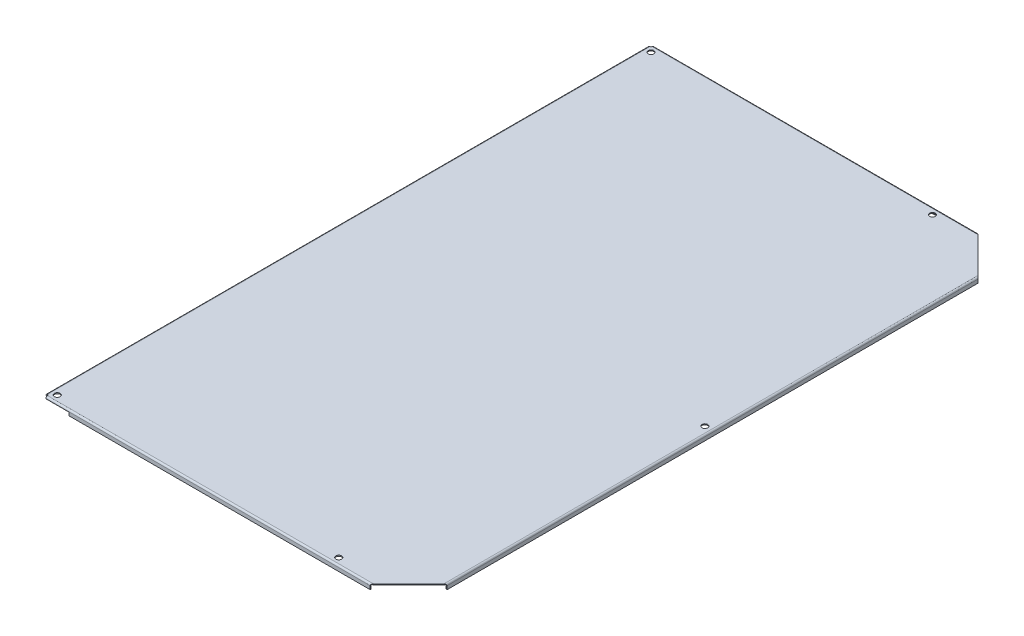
ISO-10303-21;
HEADER;
FILE_DESCRIPTION(('STEP AP214'),'2;1');
FILE_NAME('part.step','',(''),(''),'','','');
FILE_SCHEMA(('AUTOMOTIVE_DESIGN { 1 0 10303 214 1 1 1 1 }'));
ENDSEC;
DATA;
#1=APPLICATION_CONTEXT('core data for automotive mechanical design processes');
#2=APPLICATION_PROTOCOL_DEFINITION('international standard','automotive_design',2000,#1);
#3=PRODUCT_CONTEXT('',#1,'mechanical');
#4=PRODUCT('Part','Part','',(#3));
#5=PRODUCT_RELATED_PRODUCT_CATEGORY('part','',(#4));
#6=PRODUCT_DEFINITION_FORMATION('','',#4);
#7=PRODUCT_DEFINITION_CONTEXT('part definition',#1,'design');
#8=PRODUCT_DEFINITION('design','',#6,#7);
#9=PRODUCT_DEFINITION_SHAPE('','',#8);
#10=(LENGTH_UNIT() NAMED_UNIT(*) SI_UNIT(.MILLI.,.METRE.));
#11=(NAMED_UNIT(*) PLANE_ANGLE_UNIT() SI_UNIT($,.RADIAN.));
#12=(NAMED_UNIT(*) SI_UNIT($,.STERADIAN.) SOLID_ANGLE_UNIT());
#13=UNCERTAINTY_MEASURE_WITH_UNIT(LENGTH_MEASURE(1.E-05),#10,'distance_accuracy_value','');
#14=(GEOMETRIC_REPRESENTATION_CONTEXT(3) GLOBAL_UNCERTAINTY_ASSIGNED_CONTEXT((#13)) GLOBAL_UNIT_ASSIGNED_CONTEXT((#10,
#11,#12)) REPRESENTATION_CONTEXT('',''));
#15=CARTESIAN_POINT('',(0.,0.,0.));
#16=DIRECTION('',(0.,0.,1.));
#17=DIRECTION('',(1.,0.,0.));
#18=AXIS2_PLACEMENT_3D('',#15,#16,#17);
#19=CARTESIAN_POINT('',(283.5,8.,-474.));
#20=DIRECTION('',(-1.,0.,0.));
#21=DIRECTION('',(0.,0.,1.));
#22=AXIS2_PLACEMENT_3D('',#19,#20,#21);
#23=PLANE('',#22);
#24=DIRECTION('',(0.,0.,-1.));
#25=VECTOR('',#24,1.);
#26=CARTESIAN_POINT('',(283.5,5.5,-474.));
#27=LINE('',#26,#25);
#28=CARTESIAN_POINT('',(283.5,5.5,414.));
#29=VERTEX_POINT('',#28);
#30=CARTESIAN_POINT('',(283.5,5.50000000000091,-414.000000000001));
#31=VERTEX_POINT('',#30);
#32=EDGE_CURVE('E276',#29,#31,#27,.T.);
#33=ORIENTED_EDGE('',*,*,#32,.T.);
#34=DIRECTION('',(0.,1.,0.));
#35=VECTOR('',#34,1.);
#36=CARTESIAN_POINT('',(283.5,0.,-414.));
#37=LINE('',#36,#35);
#38=CARTESIAN_POINT('',(283.5,0.,-414.));
#39=VERTEX_POINT('',#38);
#40=EDGE_CURVE('E674',#31,#39,#37,.F.);
#41=ORIENTED_EDGE('',*,*,#40,.T.);
#42=DIRECTION('',(0.,0.,1.));
#43=VECTOR('',#42,1.);
#44=CARTESIAN_POINT('',(283.5,0.,-474.));
#45=LINE('',#44,#43);
#46=CARTESIAN_POINT('',(283.5,0.,414.));
#47=VERTEX_POINT('',#46);
#48=EDGE_CURVE('E668',#39,#47,#45,.T.);
#49=ORIENTED_EDGE('',*,*,#48,.T.);
#50=DIRECTION('',(0.,1.,0.));
#51=VECTOR('',#50,1.);
#52=CARTESIAN_POINT('',(283.5,0.,414.));
#53=LINE('',#52,#51);
#54=EDGE_CURVE('E848',#29,#47,#53,.F.);
#55=ORIENTED_EDGE('',*,*,#54,.F.);
#56=EDGE_LOOP('',(#33,#41,#49,#55));
#57=FACE_BOUND('',#56,.T.);
#58=ADVANCED_FACE('F17',(#57),#23,.T.);
#59=CARTESIAN_POINT('',(-285.,8.,472.5));
#60=DIRECTION('',(0.,0.,-1.));
#61=DIRECTION('',(-1.,0.,0.));
#62=AXIS2_PLACEMENT_3D('',#59,#60,#61);
#63=PLANE('',#62);
#64=DIRECTION('',(1.,0.,0.));
#65=VECTOR('',#64,1.);
#66=CARTESIAN_POINT('',(-285.,5.,472.5));
#67=LINE('',#66,#65);
#68=CARTESIAN_POINT('',(-280.585786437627,5.,472.5));
#69=VERTEX_POINT('',#68);
#70=CARTESIAN_POINT('',(-245.,5.,472.5));
#71=VERTEX_POINT('',#70);
#72=EDGE_CURVE('E280',#69,#71,#67,.T.);
#73=ORIENTED_EDGE('',*,*,#72,.F.);
#74=DIRECTION('',(0.,1.,0.));
#75=VECTOR('',#74,1.);
#76=CARTESIAN_POINT('',(-280.585786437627,6.5,472.5));
#77=LINE('',#76,#75);
#78=CARTESIAN_POINT('',(-280.585786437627,5.5,472.5));
#79=VERTEX_POINT('',#78);
#80=EDGE_CURVE('E273',#79,#69,#77,.F.);
#81=ORIENTED_EDGE('',*,*,#80,.F.);
#82=DIRECTION('',(1.,0.,0.));
#83=VECTOR('',#82,1.);
#84=CARTESIAN_POINT('',(-285.,5.5,472.5));
#85=LINE('',#84,#83);
#86=CARTESIAN_POINT('',(225.,5.50000000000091,472.5));
#87=VERTEX_POINT('',#86);
#88=EDGE_CURVE('E262',#79,#87,#85,.T.);
#89=ORIENTED_EDGE('',*,*,#88,.T.);
#90=DIRECTION('',(0.,1.,0.));
#91=VECTOR('',#90,1.);
#92=CARTESIAN_POINT('',(225.,0.,472.5));
#93=LINE('',#92,#91);
#94=CARTESIAN_POINT('',(225.,0.,472.5));
#95=VERTEX_POINT('',#94);
#96=EDGE_CURVE('E270',#87,#95,#93,.F.);
#97=ORIENTED_EDGE('',*,*,#96,.T.);
#98=DIRECTION('',(1.,0.,0.));
#99=VECTOR('',#98,1.);
#100=CARTESIAN_POINT('',(-285.,0.,472.5));
#101=LINE('',#100,#99);
#102=CARTESIAN_POINT('',(-245.,0.,472.5));
#103=VERTEX_POINT('',#102);
#104=EDGE_CURVE('E291',#95,#103,#101,.F.);
#105=ORIENTED_EDGE('',*,*,#104,.T.);
#106=DIRECTION('',(0.,1.,0.));
#107=VECTOR('',#106,1.);
#108=CARTESIAN_POINT('',(-245.,8.,472.5));
#109=LINE('',#108,#107);
#110=EDGE_CURVE('E293',#103,#71,#109,.T.);
#111=ORIENTED_EDGE('',*,*,#110,.T.);
#112=EDGE_LOOP('',(#73,#81,#89,#97,#105,#111));
#113=FACE_BOUND('',#112,.T.);
#114=ADVANCED_FACE('F269',(#113),#63,.T.);
#115=CARTESIAN_POINT('',(-285.,8.,-472.5));
#116=DIRECTION('',(0.,0.,1.));
#117=DIRECTION('',(1.,0.,0.));
#118=AXIS2_PLACEMENT_3D('',#115,#116,#117);
#119=PLANE('',#118);
#120=DIRECTION('',(1.,0.,0.));
#121=VECTOR('',#120,1.);
#122=CARTESIAN_POINT('',(-285.,5.,-472.5));
#123=LINE('',#122,#121);
#124=CARTESIAN_POINT('',(-280.585786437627,5.,-472.5));
#125=VERTEX_POINT('',#124);
#126=CARTESIAN_POINT('',(-245.,5.,-472.5));
#127=VERTEX_POINT('',#126);
#128=EDGE_CURVE('E275',#125,#127,#123,.T.);
#129=ORIENTED_EDGE('',*,*,#128,.T.);
#130=DIRECTION('',(0.,1.,0.));
#131=VECTOR('',#130,1.);
#132=CARTESIAN_POINT('',(-245.,8.,-472.5));
#133=LINE('',#132,#131);
#134=CARTESIAN_POINT('',(-245.,0.,-472.5));
#135=VERTEX_POINT('',#134);
#136=EDGE_CURVE('E655',#127,#135,#133,.F.);
#137=ORIENTED_EDGE('',*,*,#136,.T.);
#138=DIRECTION('',(1.,0.,0.));
#139=VECTOR('',#138,1.);
#140=CARTESIAN_POINT('',(-285.,0.,-472.5));
#141=LINE('',#140,#139);
#142=CARTESIAN_POINT('',(225.,0.,-472.5));
#143=VERTEX_POINT('',#142);
#144=EDGE_CURVE('E658',#135,#143,#141,.T.);
#145=ORIENTED_EDGE('',*,*,#144,.T.);
#146=DIRECTION('',(0.,1.,0.));
#147=VECTOR('',#146,1.);
#148=CARTESIAN_POINT('',(225.,0.,-472.5));
#149=LINE('',#148,#147);
#150=CARTESIAN_POINT('',(225.,5.5,-472.5));
#151=VERTEX_POINT('',#150);
#152=EDGE_CURVE('E790',#151,#143,#149,.F.);
#153=ORIENTED_EDGE('',*,*,#152,.F.);
#154=DIRECTION('',(-1.,0.,0.));
#155=VECTOR('',#154,1.);
#156=CARTESIAN_POINT('',(-285.,5.5,-472.5));
#157=LINE('',#156,#155);
#158=CARTESIAN_POINT('',(-280.585786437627,5.5,-472.5));
#159=VERTEX_POINT('',#158);
#160=EDGE_CURVE('E778',#151,#159,#157,.T.);
#161=ORIENTED_EDGE('',*,*,#160,.T.);
#162=DIRECTION('',(0.,1.,0.));
#163=VECTOR('',#162,1.);
#164=CARTESIAN_POINT('',(-280.585786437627,5.,-472.5));
#165=LINE('',#164,#163);
#166=EDGE_CURVE('E782',#125,#159,#165,.T.);
#167=ORIENTED_EDGE('',*,*,#166,.F.);
#168=EDGE_LOOP('',(#129,#137,#145,#153,#161,#167));
#169=FACE_BOUND('',#168,.T.);
#170=ADVANCED_FACE('F1058',(#169),#119,.T.);
#171=CARTESIAN_POINT('',(-283.5,8.,-474.));
#172=DIRECTION('',(1.,0.,0.));
#173=DIRECTION('',(0.,0.,-1.));
#174=AXIS2_PLACEMENT_3D('',#171,#172,#173);
#175=PLANE('',#174);
#176=DIRECTION('',(0.,1.,0.));
#177=VECTOR('',#176,1.);
#178=CARTESIAN_POINT('',(-283.5,8.,-434.));
#179=LINE('',#178,#177);
#180=CARTESIAN_POINT('',(-283.5,0.,-434.));
#181=VERTEX_POINT('',#180);
#182=CARTESIAN_POINT('',(-283.5,5.,-434.));
#183=VERTEX_POINT('',#182);
#184=EDGE_CURVE('E759',#181,#183,#179,.T.);
#185=ORIENTED_EDGE('',*,*,#184,.T.);
#186=DIRECTION('',(0.,0.,1.));
#187=VECTOR('',#186,1.);
#188=CARTESIAN_POINT('',(-283.5,5.,-474.));
#189=LINE('',#188,#187);
#190=CARTESIAN_POINT('',(-283.5,5.,-469.585786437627));
#191=VERTEX_POINT('',#190);
#192=EDGE_CURVE('E636',#183,#191,#189,.F.);
#193=ORIENTED_EDGE('',*,*,#192,.T.);
#194=DIRECTION('',(0.,1.,0.));
#195=VECTOR('',#194,1.);
#196=CARTESIAN_POINT('',(-283.5,6.5,-469.585786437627));
#197=LINE('',#196,#195);
#198=CARTESIAN_POINT('',(-283.5,5.5,-469.585786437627));
#199=VERTEX_POINT('',#198);
#200=EDGE_CURVE('E629',#199,#191,#197,.F.);
#201=ORIENTED_EDGE('',*,*,#200,.F.);
#202=DIRECTION('',(0.,0.,1.));
#203=VECTOR('',#202,1.);
#204=CARTESIAN_POINT('',(-283.5,5.5,-474.));
#205=LINE('',#204,#203);
#206=CARTESIAN_POINT('',(-283.5,5.5,469.585786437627));
#207=VERTEX_POINT('',#206);
#208=EDGE_CURVE('E698',#199,#207,#205,.T.);
#209=ORIENTED_EDGE('',*,*,#208,.T.);
#210=DIRECTION('',(0.,1.,0.));
#211=VECTOR('',#210,1.);
#212=CARTESIAN_POINT('',(-283.5,5.,469.585786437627));
#213=LINE('',#212,#211);
#214=CARTESIAN_POINT('',(-283.5,5.,469.585786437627));
#215=VERTEX_POINT('',#214);
#216=EDGE_CURVE('E749',#215,#207,#213,.T.);
#217=ORIENTED_EDGE('',*,*,#216,.F.);
#218=DIRECTION('',(0.,0.,-1.));
#219=VECTOR('',#218,1.);
#220=CARTESIAN_POINT('',(-283.5,5.,-474.));
#221=LINE('',#220,#219);
#222=CARTESIAN_POINT('',(-283.5,5.,434.));
#223=VERTEX_POINT('',#222);
#224=EDGE_CURVE('E615',#223,#215,#221,.F.);
#225=ORIENTED_EDGE('',*,*,#224,.F.);
#226=DIRECTION('',(0.,1.,0.));
#227=VECTOR('',#226,1.);
#228=CARTESIAN_POINT('',(-283.5,8.,434.));
#229=LINE('',#228,#227);
#230=CARTESIAN_POINT('',(-283.5,0.,434.));
#231=VERTEX_POINT('',#230);
#232=EDGE_CURVE('E621',#223,#231,#229,.F.);
#233=ORIENTED_EDGE('',*,*,#232,.T.);
#234=DIRECTION('',(0.,0.,1.));
#235=VECTOR('',#234,1.);
#236=CARTESIAN_POINT('',(-283.5,0.,-474.));
#237=LINE('',#236,#235);
#238=EDGE_CURVE('E620',#231,#181,#237,.F.);
#239=ORIENTED_EDGE('',*,*,#238,.T.);
#240=EDGE_LOOP('',(#185,#193,#201,#209,#217,#225,#233,#239));
#241=FACE_BOUND('',#240,.T.);
#242=ADVANCED_FACE('F1055',(#241),#175,.T.);
#243=CARTESIAN_POINT('',(-285.,0.,472.5));
#244=DIRECTION('',(0.,1.,0.));
#245=DIRECTION('',(0.,0.,1.));
#246=AXIS2_PLACEMENT_3D('',#243,#244,#245);
#247=PLANE('',#246);
#248=DIRECTION('',(0.,0.,1.));
#249=VECTOR('',#248,1.);
#250=CARTESIAN_POINT('',(225.,0.,474.));
#251=LINE('',#250,#249);
#252=CARTESIAN_POINT('',(225.,0.,474.));
#253=VERTEX_POINT('',#252);
#254=EDGE_CURVE('E255',#95,#253,#251,.T.);
#255=ORIENTED_EDGE('',*,*,#254,.T.);
#256=DIRECTION('',(-1.,0.,0.));
#257=VECTOR('',#256,1.);
#258=CARTESIAN_POINT('',(-285.,0.,474.));
#259=LINE('',#258,#257);
#260=CARTESIAN_POINT('',(-245.,0.,474.));
#261=VERTEX_POINT('',#260);
#262=EDGE_CURVE('E695',#253,#261,#259,.T.);
#263=ORIENTED_EDGE('',*,*,#262,.T.);
#264=DIRECTION('',(0.,0.,-1.));
#265=VECTOR('',#264,1.);
#266=CARTESIAN_POINT('',(-245.,0.,472.5));
#267=LINE('',#266,#265);
#268=EDGE_CURVE('E297',#261,#103,#267,.T.);
#269=ORIENTED_EDGE('',*,*,#268,.T.);
#270=ORIENTED_EDGE('',*,*,#104,.F.);
#271=EDGE_LOOP('',(#255,#263,#269,#270));
#272=FACE_BOUND('',#271,.T.);
#273=ADVANCED_FACE('F723',(#272),#247,.F.);
#274=CARTESIAN_POINT('',(-245.,8.,472.5));
#275=DIRECTION('',(1.,0.,0.));
#276=DIRECTION('',(0.,0.,-1.));
#277=AXIS2_PLACEMENT_3D('',#274,#275,#276);
#278=PLANE('',#277);
#279=DIRECTION('',(0.,1.,0.));
#280=VECTOR('',#279,1.);
#281=CARTESIAN_POINT('',(-245.,8.,474.));
#282=LINE('',#281,#280);
#283=CARTESIAN_POINT('',(-245.,5.,474.));
#284=VERTEX_POINT('',#283);
#285=EDGE_CURVE('E697',#261,#284,#282,.T.);
#286=ORIENTED_EDGE('',*,*,#285,.T.);
#287=DIRECTION('',(0.,0.,-1.));
#288=VECTOR('',#287,1.);
#289=CARTESIAN_POINT('',(-245.,5.,472.5));
#290=LINE('',#289,#288);
#291=EDGE_CURVE('E284',#71,#284,#290,.F.);
#292=ORIENTED_EDGE('',*,*,#291,.F.);
#293=ORIENTED_EDGE('',*,*,#110,.F.);
#294=ORIENTED_EDGE('',*,*,#268,.F.);
#295=EDGE_LOOP('',(#286,#292,#293,#294));
#296=FACE_BOUND('',#295,.T.);
#297=ADVANCED_FACE('F728',(#296),#278,.F.);
#298=CARTESIAN_POINT('',(-285.,5.,472.5));
#299=DIRECTION('',(0.,-1.,0.));
#300=DIRECTION('',(0.,0.,-1.));
#301=AXIS2_PLACEMENT_3D('',#298,#299,#300);
#302=PLANE('',#301);
#303=DIRECTION('',(0.,0.,1.));
#304=VECTOR('',#303,1.);
#305=CARTESIAN_POINT('',(-280.585786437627,5.,472.5));
#306=LINE('',#305,#304);
#307=CARTESIAN_POINT('',(-280.585786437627,5.,474.));
#308=VERTEX_POINT('',#307);
#309=EDGE_CURVE('E254',#69,#308,#306,.T.);
#310=ORIENTED_EDGE('',*,*,#309,.F.);
#311=ORIENTED_EDGE('',*,*,#72,.T.);
#312=ORIENTED_EDGE('',*,*,#291,.T.);
#313=DIRECTION('',(-1.,0.,0.));
#314=VECTOR('',#313,1.);
#315=CARTESIAN_POINT('',(-285.,5.,474.));
#316=LINE('',#315,#314);
#317=EDGE_CURVE('E703',#284,#308,#316,.T.);
#318=ORIENTED_EDGE('',*,*,#317,.T.);
#319=EDGE_LOOP('',(#310,#311,#312,#318));
#320=FACE_BOUND('',#319,.T.);
#321=ADVANCED_FACE('F731',(#320),#302,.T.);
#322=CARTESIAN_POINT('',(225.,0.,474.));
#323=DIRECTION('',(-1.,0.,0.));
#324=DIRECTION('',(0.,0.,1.));
#325=AXIS2_PLACEMENT_3D('',#322,#323,#324);
#326=PLANE('',#325);
#327=DIRECTION('',(0.,1.,0.));
#328=VECTOR('',#327,1.);
#329=CARTESIAN_POINT('',(225.,8.,474.));
#330=LINE('',#329,#328);
#331=CARTESIAN_POINT('',(225.,5.5,474.));
#332=VERTEX_POINT('',#331);
#333=EDGE_CURVE('E267',#332,#253,#330,.F.);
#334=ORIENTED_EDGE('',*,*,#333,.T.);
#335=ORIENTED_EDGE('',*,*,#254,.F.);
#336=ORIENTED_EDGE('',*,*,#96,.F.);
#337=DIRECTION('',(0.,0.,1.));
#338=VECTOR('',#337,1.);
#339=CARTESIAN_POINT('',(225.,5.5,474.));
#340=LINE('',#339,#338);
#341=EDGE_CURVE('E244',#332,#87,#340,.F.);
#342=ORIENTED_EDGE('',*,*,#341,.F.);
#343=EDGE_LOOP('',(#334,#335,#336,#342));
#344=FACE_BOUND('',#343,.T.);
#345=ADVANCED_FACE('F279',(#344),#326,.F.);
#346=CARTESIAN_POINT('',(-280.585786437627,6.5,472.5));
#347=DIRECTION('',(-1.,0.,0.));
#348=DIRECTION('',(0.,0.,1.));
#349=AXIS2_PLACEMENT_3D('',#346,#347,#348);
#350=PLANE('',#349);
#351=DIRECTION('',(0.,0.,1.));
#352=VECTOR('',#351,1.);
#353=CARTESIAN_POINT('',(-280.585786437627,5.5,473.25));
#354=LINE('',#353,#352);
#355=CARTESIAN_POINT('',(-280.585786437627,5.5,474.));
#356=VERTEX_POINT('',#355);
#357=EDGE_CURVE('E895',#79,#356,#354,.T.);
#358=ORIENTED_EDGE('',*,*,#357,.F.);
#359=ORIENTED_EDGE('',*,*,#80,.T.);
#360=ORIENTED_EDGE('',*,*,#309,.T.);
#361=DIRECTION('',(0.,1.,0.));
#362=VECTOR('',#361,1.);
#363=CARTESIAN_POINT('',(-280.585786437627,8.,474.));
#364=LINE('',#363,#362);
#365=EDGE_CURVE('E705',#308,#356,#364,.T.);
#366=ORIENTED_EDGE('',*,*,#365,.T.);
#367=EDGE_LOOP('',(#358,#359,#360,#366));
#368=FACE_BOUND('',#367,.T.);
#369=ADVANCED_FACE('F734',(#368),#350,.T.);
#370=CARTESIAN_POINT('',(285.,0.,-414.));
#371=DIRECTION('',(0.,0.,1.));
#372=DIRECTION('',(1.,0.,0.));
#373=AXIS2_PLACEMENT_3D('',#370,#371,#372);
#374=PLANE('',#373);
#375=DIRECTION('',(0.,1.,0.));
#376=VECTOR('',#375,1.);
#377=CARTESIAN_POINT('',(285.,8.,-414.000000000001));
#378=LINE('',#377,#376);
#379=CARTESIAN_POINT('',(285.,5.5,-414.000000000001));
#380=VERTEX_POINT('',#379);
#381=CARTESIAN_POINT('',(285.,0.,-414.000000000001));
#382=VERTEX_POINT('',#381);
#383=EDGE_CURVE('E856',#380,#382,#378,.F.);
#384=ORIENTED_EDGE('',*,*,#383,.T.);
#385=DIRECTION('',(1.,0.,0.));
#386=VECTOR('',#385,1.);
#387=CARTESIAN_POINT('',(283.5,0.,-414.));
#388=LINE('',#387,#386);
#389=EDGE_CURVE('E671',#382,#39,#388,.F.);
#390=ORIENTED_EDGE('',*,*,#389,.T.);
#391=ORIENTED_EDGE('',*,*,#40,.F.);
#392=DIRECTION('',(1.,0.,0.));
#393=VECTOR('',#392,1.);
#394=CARTESIAN_POINT('',(285.,5.5,-414.));
#395=LINE('',#394,#393);
#396=EDGE_CURVE('E676',#380,#31,#395,.F.);
#397=ORIENTED_EDGE('',*,*,#396,.F.);
#398=EDGE_LOOP('',(#384,#390,#391,#397));
#399=FACE_BOUND('',#398,.T.);
#400=ADVANCED_FACE('F1030',(#399),#374,.F.);
#401=CARTESIAN_POINT('',(283.5,0.,-474.));
#402=DIRECTION('',(0.,1.,0.));
#403=DIRECTION('',(0.,0.,1.));
#404=AXIS2_PLACEMENT_3D('',#401,#402,#403);
#405=PLANE('',#404);
#406=DIRECTION('',(1.,0.,0.));
#407=VECTOR('',#406,1.);
#408=CARTESIAN_POINT('',(285.,0.,414.));
#409=LINE('',#408,#407);
#410=CARTESIAN_POINT('',(285.,0.,414.));
#411=VERTEX_POINT('',#410);
#412=EDGE_CURVE('E670',#47,#411,#409,.T.);
#413=ORIENTED_EDGE('',*,*,#412,.F.);
#414=ORIENTED_EDGE('',*,*,#48,.F.);
#415=ORIENTED_EDGE('',*,*,#389,.F.);
#416=DIRECTION('',(0.,0.,1.));
#417=VECTOR('',#416,1.);
#418=CARTESIAN_POINT('',(285.,0.,-474.));
#419=LINE('',#418,#417);
#420=EDGE_CURVE('E853',#382,#411,#419,.T.);
#421=ORIENTED_EDGE('',*,*,#420,.T.);
#422=EDGE_LOOP('',(#413,#414,#415,#421));
#423=FACE_BOUND('',#422,.T.);
#424=ADVANCED_FACE('F1036',(#423),#405,.F.);
#425=CARTESIAN_POINT('',(285.,0.,414.));
#426=DIRECTION('',(0.,0.,1.));
#427=DIRECTION('',(1.,0.,0.));
#428=AXIS2_PLACEMENT_3D('',#425,#426,#427);
#429=PLANE('',#428);
#430=DIRECTION('',(1.,0.,1.11022302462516E-13));
#431=VECTOR('',#430,1.);
#432=CARTESIAN_POINT('',(284.25,5.5,414.));
#433=LINE('',#432,#431);
#434=CARTESIAN_POINT('',(285.,5.5,414.));
#435=VERTEX_POINT('',#434);
#436=EDGE_CURVE('E868',#29,#435,#433,.T.);
#437=ORIENTED_EDGE('',*,*,#436,.F.);
#438=ORIENTED_EDGE('',*,*,#54,.T.);
#439=ORIENTED_EDGE('',*,*,#412,.T.);
#440=DIRECTION('',(0.,1.,0.));
#441=VECTOR('',#440,1.);
#442=CARTESIAN_POINT('',(285.,8.,414.));
#443=LINE('',#442,#441);
#444=EDGE_CURVE('E855',#411,#435,#443,.T.);
#445=ORIENTED_EDGE('',*,*,#444,.T.);
#446=EDGE_LOOP('',(#437,#438,#439,#445));
#447=FACE_BOUND('',#446,.T.);
#448=ADVANCED_FACE('F864',(#447),#429,.T.);
#449=CARTESIAN_POINT('',(282.5,5.5,-474.));
#450=DIRECTION('',(0.,0.,-1.));
#451=DIRECTION('',(-1.,0.,0.));
#452=AXIS2_PLACEMENT_3D('',#449,#450,#451);
#453=CYLINDRICAL_SURFACE('',#452,1.);
#454=DIRECTION('',(0.,0.,1.));
#455=VECTOR('',#454,1.);
#456=CARTESIAN_POINT('',(282.5,6.5,0.));
#457=LINE('',#456,#455);
#458=CARTESIAN_POINT('',(282.5,6.5,416.5));
#459=VERTEX_POINT('',#458);
#460=CARTESIAN_POINT('',(282.5,6.5,-416.500000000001));
#461=VERTEX_POINT('',#460);
#462=EDGE_CURVE('E878',#459,#461,#457,.F.);
#463=ORIENTED_EDGE('',*,*,#462,.T.);
#464=CARTESIAN_POINT('',(283.5,5.50000000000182,-414.000000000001));
#465=CARTESIAN_POINT('',(283.500001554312,5.51180446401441,-413.999996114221));
#466=CARTESIAN_POINT('',(283.499790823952,5.52360180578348,-414.000522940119));
#467=CARTESIAN_POINT('',(283.49895994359,5.54707613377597,-414.002600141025));
#468=CARTESIAN_POINT('',(283.498340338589,5.55875325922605,-414.004149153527));
#469=CARTESIAN_POINT('',(283.495912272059,5.59317710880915,-414.010219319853));
#470=CARTESIAN_POINT('',(283.493533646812,5.61564249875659,-414.016165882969));
#471=CARTESIAN_POINT('',(283.486730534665,5.66468772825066,-414.033173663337));
#472=CARTESIAN_POINT('',(283.481943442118,5.69089371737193,-414.045141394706));
#473=CARTESIAN_POINT('',(283.470865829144,5.74100440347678,-414.072835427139));
#474=CARTESIAN_POINT('',(283.464567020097,5.76489535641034,-414.088582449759));
#475=CARTESIAN_POINT('',(283.446302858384,5.8257311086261,-414.13424285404));
#476=CARTESIAN_POINT('',(283.433386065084,5.86057773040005,-414.16653483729));
#477=CARTESIAN_POINT('',(283.405880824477,5.92497768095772,-414.235297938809));
#478=CARTESIAN_POINT('',(283.391288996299,5.9545199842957,-414.271777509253));
#479=CARTESIAN_POINT('',(283.359880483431,6.01161212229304,-414.350298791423));
#480=CARTESIAN_POINT('',(283.342979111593,6.03881945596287,-414.392552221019));
#481=CARTESIAN_POINT('',(283.308399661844,6.08943057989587,-414.479000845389));
#482=CARTESIAN_POINT('',(283.290720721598,6.11283000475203,-414.523198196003));
#483=CARTESIAN_POINT('',(283.254798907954,6.15656712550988,-414.613002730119));
#484=CARTESIAN_POINT('',(283.236554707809,6.17689683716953,-414.658613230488));
#485=CARTESIAN_POINT('',(283.199704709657,6.21492171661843,-414.750738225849));
#486=CARTESIAN_POINT('',(283.181099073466,6.23261803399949,-414.797252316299));
#487=CARTESIAN_POINT('',(283.139686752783,6.2692316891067,-414.900783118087));
#488=CARTESIAN_POINT('',(283.116816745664,6.28762780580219,-414.957958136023));
#489=CARTESIAN_POINT('',(283.070787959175,6.32159407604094,-415.073030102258));
#490=CARTESIAN_POINT('',(283.047629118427,6.33716361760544,-415.130927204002));
#491=CARTESIAN_POINT('',(282.977792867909,6.3801805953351,-415.305517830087));
#492=CARTESIAN_POINT('',(282.930796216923,6.40390219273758,-415.42300945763));
#493=CARTESIAN_POINT('',(282.836379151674,6.44310673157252,-415.659052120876));
#494=CARTESIAN_POINT('',(282.788958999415,6.45859445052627,-415.777602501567));
#495=CARTESIAN_POINT('',(282.693865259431,6.48225091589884,-416.015336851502));
#496=CARTESIAN_POINT('',(282.64619166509,6.49041947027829,-416.134520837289));
#497=CARTESIAN_POINT('',(282.582057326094,6.49676353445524,-416.294856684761));
#498=CARTESIAN_POINT('',(282.565631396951,6.49797937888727,-416.33592150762));
#499=CARTESIAN_POINT('',(282.532803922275,6.49959677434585,-416.417990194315));
#500=CARTESIAN_POINT('',(282.5164023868,6.49999980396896,-416.458994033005));
#501=CARTESIAN_POINT('',(282.5,6.5,-416.5));
#502=B_SPLINE_CURVE_WITH_KNOTS('',3,(#464,#465,#466,#467,#468,#469,#470,#471,#472,#473,#474,
#475,#476,#477,#478,#479,#480,#481,#482,#483,#484,#485,#486,#487,#488,#489,#490,#491,#492,#493,
#494,#495,#496,#497,#498,#499,#500,#501),.UNSPECIFIED.,.F.,.F.,(4,2,2,2,2,2,2,2,2,2,2,2,2,2,2,2,
2,2,4),(0.,0.0353868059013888,0.0707265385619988,0.140442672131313,0.22757192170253,
0.31519026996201,0.462061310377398,0.609234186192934,0.768049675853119,0.927045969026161,
1.08644893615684,1.24578211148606,1.43850404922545,1.63126766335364,2.01713658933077,
2.4027813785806,2.7884362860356,2.921165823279,3.05365369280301),.UNSPECIFIED.);
#503=EDGE_CURVE('E407',#31,#461,#502,.T.);
#504=ORIENTED_EDGE('',*,*,#503,.F.);
#505=ORIENTED_EDGE('',*,*,#32,.F.);
#506=CARTESIAN_POINT('',(282.5,6.5,416.5));
#507=CARTESIAN_POINT('',(282.536876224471,6.49997629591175,416.407809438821));
#508=CARTESIAN_POINT('',(282.57375509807,6.49795873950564,416.315612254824));
#509=CARTESIAN_POINT('',(282.647636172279,6.48975001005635,416.130909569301));
#510=CARTESIAN_POINT('',(282.684638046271,6.48353766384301,416.038404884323));
#511=CARTESIAN_POINT('',(282.758582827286,6.4667328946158,415.853542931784));
#512=CARTESIAN_POINT('',(282.795525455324,6.45613146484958,415.761186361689));
#513=CARTESIAN_POINT('',(282.869265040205,6.4301488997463,415.576837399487));
#514=CARTESIAN_POINT('',(282.906061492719,6.41475722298,415.484846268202));
#515=CARTESIAN_POINT('',(282.979235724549,6.37863309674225,415.301910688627));
#516=CARTESIAN_POINT('',(283.015614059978,6.35790888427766,415.210964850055));
#517=CARTESIAN_POINT('',(283.087761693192,6.31019241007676,415.030595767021));
#518=CARTESIAN_POINT('',(283.123531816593,6.28320952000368,414.941170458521));
#519=CARTESIAN_POINT('',(283.170170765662,6.24235847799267,414.824573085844));
#520=CARTESIAN_POINT('',(283.181468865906,6.23201292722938,414.79632783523));
#521=CARTESIAN_POINT('',(283.203946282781,6.21042419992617,414.740134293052));
#522=CARTESIAN_POINT('',(283.215125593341,6.1991809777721,414.712186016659));
#523=CARTESIAN_POINT('',(283.248513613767,6.1639144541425,414.628715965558));
#524=CARTESIAN_POINT('',(283.270513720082,6.13840462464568,414.573715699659));
#525=CARTESIAN_POINT('',(283.304351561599,6.09449204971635,414.489121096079));
#526=CARTESIAN_POINT('',(283.316488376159,6.07775497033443,414.458779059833));
#527=CARTESIAN_POINT('',(283.340380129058,6.0424176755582,414.399049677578));
#528=CARTESIAN_POINT('',(283.352135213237,6.02381818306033,414.369661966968));
#529=CARTESIAN_POINT('',(283.375088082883,5.98449709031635,414.312279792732));
#530=CARTESIAN_POINT('',(283.386287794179,5.96378371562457,414.284280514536));
#531=CARTESIAN_POINT('',(283.407957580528,5.91977926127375,414.230106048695));
#532=CARTESIAN_POINT('',(283.418428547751,5.89649142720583,414.203928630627));
#533=CARTESIAN_POINT('',(283.436511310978,5.85131998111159,414.158721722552));
#534=CARTESIAN_POINT('',(283.44429726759,5.82994747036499,414.139256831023));
#535=CARTESIAN_POINT('',(283.458882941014,5.78479238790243,414.102792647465));
#536=CARTESIAN_POINT('',(283.465681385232,5.76100677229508,414.085796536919));
#537=CARTESIAN_POINT('',(283.477953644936,5.71046227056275,414.055115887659));
#538=CARTESIAN_POINT('',(283.483404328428,5.68366161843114,414.041489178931));
#539=CARTESIAN_POINT('',(283.492208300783,5.62771414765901,414.019479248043));
#540=CARTESIAN_POINT('',(283.495573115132,5.59858124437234,414.01106721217));
#541=CARTESIAN_POINT('',(283.498411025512,5.55750119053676,414.00397243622));
#542=CARTESIAN_POINT('',(283.499003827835,5.54607876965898,414.002490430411));
#543=CARTESIAN_POINT('',(283.49979913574,5.52310730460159,414.00050216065));
#544=CARTESIAN_POINT('',(283.500000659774,5.51155801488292,413.999998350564));
#545=CARTESIAN_POINT('',(283.5,5.5,414.));
#546=B_SPLINE_CURVE_WITH_KNOTS('',3,(#506,#507,#508,#509,#510,#511,#512,#513,#514,#515,#516,
#517,#518,#519,#520,#521,#522,#523,#524,#525,#526,#527,#528,#529,#530,#531,#532,#533,#534,#535,
#536,#537,#538,#539,#540,#541,#542,#543,#544,#545),.UNSPECIFIED.,.F.,.F.,(4,2,2,2,2,2,2,2,2,2,2,
2,2,2,2,2,2,2,2,4),(0.,0.297868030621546,0.597250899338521,0.897251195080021,1.19791639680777,
1.49811992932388,1.79787681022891,1.89426080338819,1.99064969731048,2.183924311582,
2.29402644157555,2.40408599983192,2.51373253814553,2.62324238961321,2.71289463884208,
2.80266141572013,2.89387595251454,2.984581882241,3.01914027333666,3.05378524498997),.UNSPECIFIED.);
#547=EDGE_CURVE('E452',#459,#29,#546,.T.);
#548=ORIENTED_EDGE('',*,*,#547,.F.);
#549=EDGE_LOOP('',(#463,#504,#505,#548));
#550=FACE_BOUND('',#549,.T.);
#551=ADVANCED_FACE('F443',(#550),#453,.F.);
#552=CARTESIAN_POINT('',(-285.,5.5,471.5));
#553=DIRECTION('',(1.,0.,0.));
#554=DIRECTION('',(0.,0.,-1.));
#555=AXIS2_PLACEMENT_3D('',#552,#553,#554);
#556=CYLINDRICAL_SURFACE('',#555,1.);
#557=ORIENTED_EDGE('',*,*,#88,.F.);
#558=CARTESIAN_POINT('',(-281.,6.5,471.5));
#559=CARTESIAN_POINT('',(-280.999994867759,6.50000371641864,471.523969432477));
#560=CARTESIAN_POINT('',(-280.999013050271,6.49913797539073,471.547905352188));
#561=CARTESIAN_POINT('',(-280.995386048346,6.49571507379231,471.595486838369));
#562=CARTESIAN_POINT('',(-280.992744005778,6.49316110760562,471.619132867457));
#563=CARTESIAN_POINT('',(-280.98281281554,6.48309190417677,471.689028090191));
#564=CARTESIAN_POINT('',(-280.973508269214,6.47316757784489,471.734659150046));
#565=CARTESIAN_POINT('',(-280.951380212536,6.4475402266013,471.822908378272));
#566=CARTESIAN_POINT('',(-280.938582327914,6.43187900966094,471.865545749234));
#567=CARTESIAN_POINT('',(-280.910688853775,6.39527154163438,471.947793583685));
#568=CARTESIAN_POINT('',(-280.895587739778,6.37431250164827,471.987396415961));
#569=CARTESIAN_POINT('',(-280.860894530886,6.3229110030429,472.070673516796));
#570=CARTESIAN_POINT('',(-280.841008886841,6.29140979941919,472.113573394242));
#571=CARTESIAN_POINT('',(-280.800668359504,6.22218818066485,472.193721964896));
#572=CARTESIAN_POINT('',(-280.780213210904,6.18446482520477,472.230967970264));
#573=CARTESIAN_POINT('',(-280.73740069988,6.09822600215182,472.303551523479));
#574=CARTESIAN_POINT('',(-280.715132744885,6.04894798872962,472.338042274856));
#575=CARTESIAN_POINT('',(-280.673389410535,5.94405307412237,472.398030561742));
#576=CARTESIAN_POINT('',(-280.653913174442,5.88843812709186,472.42353085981));
#577=CARTESIAN_POINT('',(-280.625370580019,5.78908830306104,472.458297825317));
#578=CARTESIAN_POINT('',(-280.614925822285,5.74664039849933,472.470131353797));
#579=CARTESIAN_POINT('',(-280.598190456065,5.65985582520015,472.488123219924));
#580=CARTESIAN_POINT('',(-280.591882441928,5.61552791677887,472.494305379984));
#581=CARTESIAN_POINT('',(-280.586750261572,5.54727972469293,472.499165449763));
#582=CARTESIAN_POINT('',(-280.585795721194,5.52364981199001,472.500011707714));
#583=CARTESIAN_POINT('',(-280.585786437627,5.5,472.5));
#584=B_SPLINE_CURVE_WITH_KNOTS('',3,(#558,#559,#560,#561,#562,#563,#564,#565,#566,#567,#568,
#569,#570,#571,#572,#573,#574,#575,#576,#577,#578,#579,#580,#581,#582,#583),.UNSPECIFIED.,.F.,
.F.,(4,2,2,2,2,2,2,2,2,2,2,2,4),(0.,0.0718194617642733,0.143503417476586,0.285617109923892,
0.426715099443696,0.568157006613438,0.737942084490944,0.907807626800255,1.09930104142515,
1.29073556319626,1.42614133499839,1.56097365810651,1.63186947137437),.UNSPECIFIED.);
#585=CARTESIAN_POINT('',(-281.,6.5,471.5));
#586=VERTEX_POINT('',#585);
#587=EDGE_CURVE('E447',#586,#79,#584,.T.);
#588=ORIENTED_EDGE('',*,*,#587,.F.);
#589=DIRECTION('',(1.,0.,0.));
#590=VECTOR('',#589,1.);
#591=CARTESIAN_POINT('',(0.,6.5,471.5));
#592=LINE('',#591,#590);
#593=CARTESIAN_POINT('',(227.5,6.5,471.5));
#594=VERTEX_POINT('',#593);
#595=EDGE_CURVE('E265',#586,#594,#592,.T.);
#596=ORIENTED_EDGE('',*,*,#595,.T.);
#597=CARTESIAN_POINT('',(225.,5.50000000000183,472.5));
#598=CARTESIAN_POINT('',(224.999996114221,5.5118044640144,472.500001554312));
#599=CARTESIAN_POINT('',(225.000522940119,5.52360180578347,472.499790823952));
#600=CARTESIAN_POINT('',(225.002600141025,5.54707613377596,472.49895994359));
#601=CARTESIAN_POINT('',(225.004149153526,5.55875325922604,472.498340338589));
#602=CARTESIAN_POINT('',(225.010219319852,5.59317710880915,472.495912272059));
#603=CARTESIAN_POINT('',(225.016165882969,5.61564249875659,472.493533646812));
#604=CARTESIAN_POINT('',(225.033173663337,5.66468772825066,472.486730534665));
#605=CARTESIAN_POINT('',(225.045141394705,5.69089371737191,472.481943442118));
#606=CARTESIAN_POINT('',(225.072835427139,5.74100440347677,472.470865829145));
#607=CARTESIAN_POINT('',(225.088582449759,5.76489535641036,472.464567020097));
#608=CARTESIAN_POINT('',(225.134242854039,5.82573110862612,472.446302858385));
#609=CARTESIAN_POINT('',(225.16653483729,5.86057773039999,472.433386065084));
#610=CARTESIAN_POINT('',(225.235297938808,5.92497768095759,472.405880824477));
#611=CARTESIAN_POINT('',(225.271777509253,5.95451998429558,472.391288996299));
#612=CARTESIAN_POINT('',(225.350298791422,6.01161212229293,472.359880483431));
#613=CARTESIAN_POINT('',(225.392552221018,6.03881945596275,472.342979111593));
#614=CARTESIAN_POINT('',(225.479000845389,6.08943057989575,472.308399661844));
#615=CARTESIAN_POINT('',(225.523198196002,6.11283000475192,472.290720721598));
#616=CARTESIAN_POINT('',(225.613002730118,6.15656712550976,472.254798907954));
#617=CARTESIAN_POINT('',(225.658613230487,6.17689683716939,472.236554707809));
#618=CARTESIAN_POINT('',(225.750738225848,6.21492171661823,472.199704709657));
#619=CARTESIAN_POINT('',(225.797252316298,6.23261803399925,472.181099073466));
#620=CARTESIAN_POINT('',(225.900783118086,6.26923168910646,472.139686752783));
#621=CARTESIAN_POINT('',(225.957958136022,6.287627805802,472.116816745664));
#622=CARTESIAN_POINT('',(226.073030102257,6.32159407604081,472.070787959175));
#623=CARTESIAN_POINT('',(226.130927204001,6.3371636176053,472.047629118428));
#624=CARTESIAN_POINT('',(226.305517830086,6.38018059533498,471.977792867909));
#625=CARTESIAN_POINT('',(226.423009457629,6.40390219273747,471.930796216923));
#626=CARTESIAN_POINT('',(226.659052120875,6.44310673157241,471.836379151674));
#627=CARTESIAN_POINT('',(226.777602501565,6.45859445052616,471.788958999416));
#628=CARTESIAN_POINT('',(227.0153368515,6.48225091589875,471.693865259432));
#629=CARTESIAN_POINT('',(227.134520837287,6.49041947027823,471.64619166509));
#630=CARTESIAN_POINT('',(227.294856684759,6.49676353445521,471.582057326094));
#631=CARTESIAN_POINT('',(227.335921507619,6.49797937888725,471.565631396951));
#632=CARTESIAN_POINT('',(227.417990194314,6.49959677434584,471.532803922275));
#633=CARTESIAN_POINT('',(227.458994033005,6.49999980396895,471.5164023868));
#634=CARTESIAN_POINT('',(227.5,6.5,471.5));
#635=B_SPLINE_CURVE_WITH_KNOTS('',3,(#597,#598,#599,#600,#601,#602,#603,#604,#605,#606,#607,
#608,#609,#610,#611,#612,#613,#614,#615,#616,#617,#618,#619,#620,#621,#622,#623,#624,#625,#626,
#627,#628,#629,#630,#631,#632,#633,#634),.UNSPECIFIED.,.F.,.F.,(4,2,2,2,2,2,2,2,2,2,2,2,2,2,2,2,
2,2,4),(0.,0.0353868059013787,0.0707265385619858,0.140442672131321,0.227571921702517,
0.315190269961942,0.462061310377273,0.609234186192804,0.768049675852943,0.927045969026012,
1.08644893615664,1.24578211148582,1.43850404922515,1.63126766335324,2.01713658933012,
2.40278137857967,2.78843628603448,2.92116582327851,3.05365369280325),.UNSPECIFIED.);
#636=EDGE_CURVE('E24',#87,#594,#635,.T.);
#637=ORIENTED_EDGE('',*,*,#636,.F.);
#638=EDGE_LOOP('',(#557,#588,#596,#637));
#639=FACE_BOUND('',#638,.T.);
#640=ADVANCED_FACE('F261',(#639),#556,.F.);
#641=CARTESIAN_POINT('',(-285.,5.,-472.5));
#642=DIRECTION('',(0.,1.,0.));
#643=DIRECTION('',(0.,0.,1.));
#644=AXIS2_PLACEMENT_3D('',#641,#642,#643);
#645=PLANE('',#644);
#646=DIRECTION('',(1.,0.,0.));
#647=VECTOR('',#646,1.);
#648=CARTESIAN_POINT('',(-285.,5.,-474.));
#649=LINE('',#648,#647);
#650=CARTESIAN_POINT('',(-280.585786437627,5.,-474.));
#651=VERTEX_POINT('',#650);
#652=CARTESIAN_POINT('',(-245.,5.,-474.));
#653=VERTEX_POINT('',#652);
#654=EDGE_CURVE('E804',#651,#653,#649,.T.);
#655=ORIENTED_EDGE('',*,*,#654,.T.);
#656=DIRECTION('',(0.,0.,-1.));
#657=VECTOR('',#656,1.);
#658=CARTESIAN_POINT('',(-245.,5.,-472.5));
#659=LINE('',#658,#657);
#660=EDGE_CURVE('E665',#653,#127,#659,.F.);
#661=ORIENTED_EDGE('',*,*,#660,.T.);
#662=ORIENTED_EDGE('',*,*,#128,.F.);
#663=DIRECTION('',(0.,0.,1.));
#664=VECTOR('',#663,1.);
#665=CARTESIAN_POINT('',(-280.585786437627,5.,-472.5));
#666=LINE('',#665,#664);
#667=EDGE_CURVE('E785',#651,#125,#666,.T.);
#668=ORIENTED_EDGE('',*,*,#667,.F.);
#669=EDGE_LOOP('',(#655,#661,#662,#668));
#670=FACE_BOUND('',#669,.T.);
#671=ADVANCED_FACE('F437',(#670),#645,.F.);
#672=CARTESIAN_POINT('',(-245.,8.,-472.5));
#673=DIRECTION('',(1.,0.,0.));
#674=DIRECTION('',(0.,0.,-1.));
#675=AXIS2_PLACEMENT_3D('',#672,#673,#674);
#676=PLANE('',#675);
#677=DIRECTION('',(0.,1.,0.));
#678=VECTOR('',#677,1.);
#679=CARTESIAN_POINT('',(-245.,8.,-474.));
#680=LINE('',#679,#678);
#681=CARTESIAN_POINT('',(-245.,0.,-474.));
#682=VERTEX_POINT('',#681);
#683=EDGE_CURVE('E796',#653,#682,#680,.F.);
#684=ORIENTED_EDGE('',*,*,#683,.T.);
#685=DIRECTION('',(0.,0.,1.));
#686=VECTOR('',#685,1.);
#687=CARTESIAN_POINT('',(-245.,0.,-472.5));
#688=LINE('',#687,#686);
#689=EDGE_CURVE('E661',#682,#135,#688,.T.);
#690=ORIENTED_EDGE('',*,*,#689,.T.);
#691=ORIENTED_EDGE('',*,*,#136,.F.);
#692=ORIENTED_EDGE('',*,*,#660,.F.);
#693=EDGE_LOOP('',(#684,#690,#691,#692));
#694=FACE_BOUND('',#693,.T.);
#695=ADVANCED_FACE('F433',(#694),#676,.F.);
#696=CARTESIAN_POINT('',(-285.,0.,-472.5));
#697=DIRECTION('',(0.,1.,0.));
#698=DIRECTION('',(0.,0.,1.));
#699=AXIS2_PLACEMENT_3D('',#696,#697,#698);
#700=PLANE('',#699);
#701=DIRECTION('',(0.,0.,-1.));
#702=VECTOR('',#701,1.);
#703=CARTESIAN_POINT('',(225.,0.,-474.));
#704=LINE('',#703,#702);
#705=CARTESIAN_POINT('',(225.,0.,-474.));
#706=VERTEX_POINT('',#705);
#707=EDGE_CURVE('E660',#143,#706,#704,.T.);
#708=ORIENTED_EDGE('',*,*,#707,.F.);
#709=ORIENTED_EDGE('',*,*,#144,.F.);
#710=ORIENTED_EDGE('',*,*,#689,.F.);
#711=DIRECTION('',(1.,0.,0.));
#712=VECTOR('',#711,1.);
#713=CARTESIAN_POINT('',(-285.,0.,-474.));
#714=LINE('',#713,#712);
#715=EDGE_CURVE('E793',#682,#706,#714,.T.);
#716=ORIENTED_EDGE('',*,*,#715,.T.);
#717=EDGE_LOOP('',(#708,#709,#710,#716));
#718=FACE_BOUND('',#717,.T.);
#719=ADVANCED_FACE('F429',(#718),#700,.F.);
#720=CARTESIAN_POINT('',(225.,0.,-474.));
#721=DIRECTION('',(1.,0.,0.));
#722=DIRECTION('',(0.,0.,-1.));
#723=AXIS2_PLACEMENT_3D('',#720,#721,#722);
#724=PLANE('',#723);
#725=DIRECTION('',(0.,0.,-1.));
#726=VECTOR('',#725,1.);
#727=CARTESIAN_POINT('',(225.,5.5,-473.25));
#728=LINE('',#727,#726);
#729=CARTESIAN_POINT('',(225.,5.5,-474.));
#730=VERTEX_POINT('',#729);
#731=EDGE_CURVE('E401',#151,#730,#728,.T.);
#732=ORIENTED_EDGE('',*,*,#731,.F.);
#733=ORIENTED_EDGE('',*,*,#152,.T.);
#734=ORIENTED_EDGE('',*,*,#707,.T.);
#735=DIRECTION('',(0.,1.,0.));
#736=VECTOR('',#735,1.);
#737=CARTESIAN_POINT('',(225.,8.,-474.));
#738=LINE('',#737,#736);
#739=EDGE_CURVE('E795',#706,#730,#738,.T.);
#740=ORIENTED_EDGE('',*,*,#739,.T.);
#741=EDGE_LOOP('',(#732,#733,#734,#740));
#742=FACE_BOUND('',#741,.T.);
#743=ADVANCED_FACE('F425',(#742),#724,.T.);
#744=CARTESIAN_POINT('',(-280.585786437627,5.,-472.5));
#745=DIRECTION('',(-1.,0.,0.));
#746=DIRECTION('',(0.,0.,1.));
#747=AXIS2_PLACEMENT_3D('',#744,#745,#746);
#748=PLANE('',#747);
#749=ORIENTED_EDGE('',*,*,#667,.T.);
#750=ORIENTED_EDGE('',*,*,#166,.T.);
#751=DIRECTION('',(0.,0.,1.));
#752=VECTOR('',#751,1.);
#753=CARTESIAN_POINT('',(-280.585786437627,5.5,-473.25));
#754=LINE('',#753,#752);
#755=CARTESIAN_POINT('',(-280.585786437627,5.5,-474.));
#756=VERTEX_POINT('',#755);
#757=EDGE_CURVE('E937',#756,#159,#754,.T.);
#758=ORIENTED_EDGE('',*,*,#757,.F.);
#759=DIRECTION('',(0.,1.,0.));
#760=VECTOR('',#759,1.);
#761=CARTESIAN_POINT('',(-280.585786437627,8.,-474.));
#762=LINE('',#761,#760);
#763=EDGE_CURVE('E812',#756,#651,#762,.F.);
#764=ORIENTED_EDGE('',*,*,#763,.T.);
#765=EDGE_LOOP('',(#749,#750,#758,#764));
#766=FACE_BOUND('',#765,.T.);
#767=ADVANCED_FACE('F419',(#766),#748,.T.);
#768=CARTESIAN_POINT('',(-285.,5.5,-471.5));
#769=DIRECTION('',(-1.,0.,0.));
#770=DIRECTION('',(0.,0.,1.));
#771=AXIS2_PLACEMENT_3D('',#768,#769,#770);
#772=CYLINDRICAL_SURFACE('',#771,1.);
#773=DIRECTION('',(1.,0.,0.));
#774=VECTOR('',#773,1.);
#775=CARTESIAN_POINT('',(0.,6.5,-471.5));
#776=LINE('',#775,#774);
#777=CARTESIAN_POINT('',(227.5,6.5,-471.5));
#778=VERTEX_POINT('',#777);
#779=CARTESIAN_POINT('',(-281.,6.5,-471.5));
#780=VERTEX_POINT('',#779);
#781=EDGE_CURVE('E844',#778,#780,#776,.F.);
#782=ORIENTED_EDGE('',*,*,#781,.T.);
#783=CARTESIAN_POINT('',(-280.585786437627,5.5,-472.5));
#784=CARTESIAN_POINT('',(-280.585791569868,5.52396943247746,-472.500003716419));
#785=CARTESIAN_POINT('',(-280.586773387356,5.54790535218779,-472.499137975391));
#786=CARTESIAN_POINT('',(-280.590400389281,5.59548683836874,-472.495715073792));
#787=CARTESIAN_POINT('',(-280.593042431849,5.61913286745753,-472.493161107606));
#788=CARTESIAN_POINT('',(-280.602973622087,5.68902809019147,-472.483091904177));
#789=CARTESIAN_POINT('',(-280.612278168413,5.73465915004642,-472.473167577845));
#790=CARTESIAN_POINT('',(-280.634406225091,5.8229083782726,-472.447540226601));
#791=CARTESIAN_POINT('',(-280.647204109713,5.86554574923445,-472.431879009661));
#792=CARTESIAN_POINT('',(-280.675097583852,5.94779358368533,-472.395271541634));
#793=CARTESIAN_POINT('',(-280.690198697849,5.98739641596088,-472.374312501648));
#794=CARTESIAN_POINT('',(-280.724891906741,6.07067351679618,-472.322911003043));
#795=CARTESIAN_POINT('',(-280.744777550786,6.1135733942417,-472.291409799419));
#796=CARTESIAN_POINT('',(-280.785118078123,6.19372196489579,-472.222188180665));
#797=CARTESIAN_POINT('',(-280.805573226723,6.23096797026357,-472.184464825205));
#798=CARTESIAN_POINT('',(-280.848385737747,6.30355152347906,-472.098226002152));
#799=CARTESIAN_POINT('',(-280.870653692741,6.33804227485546,-472.04894798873));
#800=CARTESIAN_POINT('',(-280.912397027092,6.39803056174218,-471.944053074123));
#801=CARTESIAN_POINT('',(-280.931873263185,6.42353085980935,-471.888438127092));
#802=CARTESIAN_POINT('',(-280.960415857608,6.45829782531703,-471.789088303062));
#803=CARTESIAN_POINT('',(-280.970860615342,6.47013135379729,-471.7466403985));
#804=CARTESIAN_POINT('',(-280.987595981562,6.48812321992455,-471.659855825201));
#805=CARTESIAN_POINT('',(-280.993903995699,6.49430537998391,-471.61552791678));
#806=CARTESIAN_POINT('',(-280.999036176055,6.4991654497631,-471.547279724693));
#807=CARTESIAN_POINT('',(-280.999990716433,6.50001170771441,-471.52364981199));
#808=CARTESIAN_POINT('',(-281.,6.5,-471.5));
#809=B_SPLINE_CURVE_WITH_KNOTS('',3,(#783,#784,#785,#786,#787,#788,#789,#790,#791,#792,#793,
#794,#795,#796,#797,#798,#799,#800,#801,#802,#803,#804,#805,#806,#807,#808),.UNSPECIFIED.,.F.,
.F.,(4,2,2,2,2,2,2,2,2,2,2,2,4),(0.,0.071819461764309,0.14350341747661,0.285617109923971,
0.426715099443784,0.568157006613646,0.737942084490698,0.907807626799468,1.09930104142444,
1.29073556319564,1.42614133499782,1.56097365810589,1.6318694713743),.UNSPECIFIED.);
#810=EDGE_CURVE('E402',#159,#780,#809,.T.);
#811=ORIENTED_EDGE('',*,*,#810,.F.);
#812=ORIENTED_EDGE('',*,*,#160,.F.);
#813=CARTESIAN_POINT('',(227.5,6.5,-471.5));
#814=CARTESIAN_POINT('',(227.407809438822,6.49997629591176,-471.536876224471));
#815=CARTESIAN_POINT('',(227.315612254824,6.49795873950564,-471.573755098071));
#816=CARTESIAN_POINT('',(227.130909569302,6.48975001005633,-471.64763617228));
#817=CARTESIAN_POINT('',(227.038404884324,6.48353766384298,-471.684638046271));
#818=CARTESIAN_POINT('',(226.853542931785,6.46673289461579,-471.758582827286));
#819=CARTESIAN_POINT('',(226.76118636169,6.4561314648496,-471.795525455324));
#820=CARTESIAN_POINT('',(226.576837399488,6.43014889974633,-471.869265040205));
#821=CARTESIAN_POINT('',(226.484846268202,6.41475722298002,-471.906061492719));
#822=CARTESIAN_POINT('',(226.301910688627,6.3786330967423,-471.979235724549));
#823=CARTESIAN_POINT('',(226.210964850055,6.35790888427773,-472.015614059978));
#824=CARTESIAN_POINT('',(226.030595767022,6.31019241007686,-472.087761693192));
#825=CARTESIAN_POINT('',(225.941170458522,6.28320952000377,-472.123531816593));
#826=CARTESIAN_POINT('',(225.824573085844,6.24235847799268,-472.170170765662));
#827=CARTESIAN_POINT('',(225.796327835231,6.23201292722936,-472.181468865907));
#828=CARTESIAN_POINT('',(225.740134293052,6.21042419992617,-472.203946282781));
#829=CARTESIAN_POINT('',(225.712186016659,6.19918097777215,-472.215125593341));
#830=CARTESIAN_POINT('',(225.628715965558,6.1639144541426,-472.248513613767));
#831=CARTESIAN_POINT('',(225.57371569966,6.13840462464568,-472.270513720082));
#832=CARTESIAN_POINT('',(225.489121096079,6.09449204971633,-472.304351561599));
#833=CARTESIAN_POINT('',(225.458779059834,6.07775497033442,-472.316488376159));
#834=CARTESIAN_POINT('',(225.399049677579,6.04241767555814,-472.340380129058));
#835=CARTESIAN_POINT('',(225.369661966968,6.02381818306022,-472.352135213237));
#836=CARTESIAN_POINT('',(225.312279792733,5.98449709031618,-472.375088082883));
#837=CARTESIAN_POINT('',(225.284280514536,5.96378371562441,-472.386287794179));
#838=CARTESIAN_POINT('',(225.230106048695,5.91977926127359,-472.407957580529));
#839=CARTESIAN_POINT('',(225.203928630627,5.89649142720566,-472.418428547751));
#840=CARTESIAN_POINT('',(225.158721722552,5.85131998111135,-472.436511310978));
#841=CARTESIAN_POINT('',(225.139256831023,5.82994747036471,-472.444297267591));
#842=CARTESIAN_POINT('',(225.102792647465,5.78479238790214,-472.458882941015));
#843=CARTESIAN_POINT('',(225.085796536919,5.76100677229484,-472.465681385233));
#844=CARTESIAN_POINT('',(225.055115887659,5.71046227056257,-472.477953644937));
#845=CARTESIAN_POINT('',(225.041489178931,5.68366161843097,-472.483404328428));
#846=CARTESIAN_POINT('',(225.019479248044,5.62771414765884,-472.492208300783));
#847=CARTESIAN_POINT('',(225.01106721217,5.59858124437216,-472.495573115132));
#848=CARTESIAN_POINT('',(225.00397243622,5.55750119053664,-472.498411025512));
#849=CARTESIAN_POINT('',(225.002490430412,5.54607876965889,-472.499003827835));
#850=CARTESIAN_POINT('',(225.00050216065,5.52310730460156,-472.49979913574));
#851=CARTESIAN_POINT('',(224.999998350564,5.51155801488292,-472.500000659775));
#852=CARTESIAN_POINT('',(225.,5.5,-472.5));
#853=B_SPLINE_CURVE_WITH_KNOTS('',3,(#813,#814,#815,#816,#817,#818,#819,#820,#821,#822,#823,
#824,#825,#826,#827,#828,#829,#830,#831,#832,#833,#834,#835,#836,#837,#838,#839,#840,#841,#842,
#843,#844,#845,#846,#847,#848,#849,#850,#851,#852),.UNSPECIFIED.,.F.,.F.,(4,2,2,2,2,2,2,2,2,2,2,
2,2,2,2,2,2,2,2,4),(0.,0.297868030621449,0.597250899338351,0.897251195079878,1.19791639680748,
1.49811992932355,1.79787681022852,1.89426080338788,1.99064969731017,2.18392431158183,
2.29402644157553,2.40408599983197,2.51373253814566,2.62324238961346,2.71289463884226,
2.80266141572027,2.89387595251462,2.98458188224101,3.0191402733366,3.05378524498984),.UNSPECIFIED.);
#854=EDGE_CURVE('E393',#778,#151,#853,.T.);
#855=ORIENTED_EDGE('',*,*,#854,.F.);
#856=EDGE_LOOP('',(#782,#811,#812,#855));
#857=FACE_BOUND('',#856,.T.);
#858=ADVANCED_FACE('F413',(#857),#772,.F.);
#859=CARTESIAN_POINT('',(-283.5,6.5,-469.585786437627));
#860=DIRECTION('',(0.,0.,-1.));
#861=DIRECTION('',(-1.,0.,0.));
#862=AXIS2_PLACEMENT_3D('',#859,#860,#861);
#863=PLANE('',#862);
#864=DIRECTION('',(-1.,0.,0.));
#865=VECTOR('',#864,1.);
#866=CARTESIAN_POINT('',(-284.25,5.5,-469.585786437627));
#867=LINE('',#866,#865);
#868=CARTESIAN_POINT('',(-285.,5.5,-469.585786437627));
#869=VERTEX_POINT('',#868);
#870=EDGE_CURVE('E932',#199,#869,#867,.T.);
#871=ORIENTED_EDGE('',*,*,#870,.F.);
#872=ORIENTED_EDGE('',*,*,#200,.T.);
#873=DIRECTION('',(1.,0.,0.));
#874=VECTOR('',#873,1.);
#875=CARTESIAN_POINT('',(-283.5,5.,-469.585786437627));
#876=LINE('',#875,#874);
#877=CARTESIAN_POINT('',(-285.,5.,-469.585786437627));
#878=VERTEX_POINT('',#877);
#879=EDGE_CURVE('E638',#191,#878,#876,.F.);
#880=ORIENTED_EDGE('',*,*,#879,.T.);
#881=DIRECTION('',(0.,1.,0.));
#882=VECTOR('',#881,1.);
#883=CARTESIAN_POINT('',(-285.,6.5,-469.585786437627));
#884=LINE('',#883,#882);
#885=EDGE_CURVE('E774',#878,#869,#884,.T.);
#886=ORIENTED_EDGE('',*,*,#885,.T.);
#887=EDGE_LOOP('',(#871,#872,#880,#886));
#888=FACE_BOUND('',#887,.T.);
#889=ADVANCED_FACE('F418',(#888),#863,.T.);
#890=CARTESIAN_POINT('',(-283.5,5.,-474.));
#891=DIRECTION('',(0.,-1.,0.));
#892=DIRECTION('',(0.,0.,-1.));
#893=AXIS2_PLACEMENT_3D('',#890,#891,#892);
#894=PLANE('',#893);
#895=DIRECTION('',(-1.,0.,0.));
#896=VECTOR('',#895,1.);
#897=CARTESIAN_POINT('',(-283.5,5.,434.));
#898=LINE('',#897,#896);
#899=CARTESIAN_POINT('',(-285.,5.,434.));
#900=VERTEX_POINT('',#899);
#901=EDGE_CURVE('E613',#900,#223,#898,.F.);
#902=ORIENTED_EDGE('',*,*,#901,.T.);
#903=ORIENTED_EDGE('',*,*,#224,.T.);
#904=DIRECTION('',(1.,0.,0.));
#905=VECTOR('',#904,1.);
#906=CARTESIAN_POINT('',(-283.5,5.,469.585786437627));
#907=LINE('',#906,#905);
#908=CARTESIAN_POINT('',(-285.,5.,469.585786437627));
#909=VERTEX_POINT('',#908);
#910=EDGE_CURVE('E752',#909,#215,#907,.T.);
#911=ORIENTED_EDGE('',*,*,#910,.F.);
#912=DIRECTION('',(0.,0.,-1.));
#913=VECTOR('',#912,1.);
#914=CARTESIAN_POINT('',(-285.,5.,-474.));
#915=LINE('',#914,#913);
#916=EDGE_CURVE('E618',#909,#900,#915,.T.);
#917=ORIENTED_EDGE('',*,*,#916,.T.);
#918=EDGE_LOOP('',(#902,#903,#911,#917));
#919=FACE_BOUND('',#918,.T.);
#920=ADVANCED_FACE('F603',(#919),#894,.T.);
#921=CARTESIAN_POINT('',(-283.5,8.,434.));
#922=DIRECTION('',(0.,0.,-1.));
#923=DIRECTION('',(-1.,0.,0.));
#924=AXIS2_PLACEMENT_3D('',#921,#922,#923);
#925=PLANE('',#924);
#926=DIRECTION('',(0.,1.,0.));
#927=VECTOR('',#926,1.);
#928=CARTESIAN_POINT('',(-285.,8.,434.));
#929=LINE('',#928,#927);
#930=CARTESIAN_POINT('',(-285.,0.,434.));
#931=VERTEX_POINT('',#930);
#932=EDGE_CURVE('E768',#900,#931,#929,.F.);
#933=ORIENTED_EDGE('',*,*,#932,.T.);
#934=DIRECTION('',(1.,0.,0.));
#935=VECTOR('',#934,1.);
#936=CARTESIAN_POINT('',(-283.5,0.,434.));
#937=LINE('',#936,#935);
#938=EDGE_CURVE('E625',#931,#231,#937,.T.);
#939=ORIENTED_EDGE('',*,*,#938,.T.);
#940=ORIENTED_EDGE('',*,*,#232,.F.);
#941=ORIENTED_EDGE('',*,*,#901,.F.);
#942=EDGE_LOOP('',(#933,#939,#940,#941));
#943=FACE_BOUND('',#942,.T.);
#944=ADVANCED_FACE('F600',(#943),#925,.F.);
#945=CARTESIAN_POINT('',(-283.5,0.,-474.));
#946=DIRECTION('',(0.,1.,0.));
#947=DIRECTION('',(0.,0.,1.));
#948=AXIS2_PLACEMENT_3D('',#945,#946,#947);
#949=PLANE('',#948);
#950=DIRECTION('',(0.,0.,-1.));
#951=VECTOR('',#950,1.);
#952=CARTESIAN_POINT('',(-285.,0.,-474.));
#953=LINE('',#952,#951);
#954=CARTESIAN_POINT('',(-285.,0.,-434.));
#955=VERTEX_POINT('',#954);
#956=EDGE_CURVE('E925',#931,#955,#953,.T.);
#957=ORIENTED_EDGE('',*,*,#956,.T.);
#958=DIRECTION('',(1.,0.,0.));
#959=VECTOR('',#958,1.);
#960=CARTESIAN_POINT('',(-283.5,0.,-434.));
#961=LINE('',#960,#959);
#962=EDGE_CURVE('E639',#955,#181,#961,.T.);
#963=ORIENTED_EDGE('',*,*,#962,.T.);
#964=ORIENTED_EDGE('',*,*,#238,.F.);
#965=ORIENTED_EDGE('',*,*,#938,.F.);
#966=EDGE_LOOP('',(#957,#963,#964,#965));
#967=FACE_BOUND('',#966,.T.);
#968=ADVANCED_FACE('F596',(#967),#949,.F.);
#969=CARTESIAN_POINT('',(-283.5,8.,-434.));
#970=DIRECTION('',(0.,0.,1.));
#971=DIRECTION('',(1.,0.,0.));
#972=AXIS2_PLACEMENT_3D('',#969,#970,#971);
#973=PLANE('',#972);
#974=DIRECTION('',(0.,1.,0.));
#975=VECTOR('',#974,1.);
#976=CARTESIAN_POINT('',(-285.,8.,-434.));
#977=LINE('',#976,#975);
#978=CARTESIAN_POINT('',(-285.,5.,-434.));
#979=VERTEX_POINT('',#978);
#980=EDGE_CURVE('E651',#955,#979,#977,.T.);
#981=ORIENTED_EDGE('',*,*,#980,.T.);
#982=DIRECTION('',(1.,0.,0.));
#983=VECTOR('',#982,1.);
#984=CARTESIAN_POINT('',(-283.5,5.,-434.));
#985=LINE('',#984,#983);
#986=EDGE_CURVE('E644',#979,#183,#985,.T.);
#987=ORIENTED_EDGE('',*,*,#986,.T.);
#988=ORIENTED_EDGE('',*,*,#184,.F.);
#989=ORIENTED_EDGE('',*,*,#962,.F.);
#990=EDGE_LOOP('',(#981,#987,#988,#989));
#991=FACE_BOUND('',#990,.T.);
#992=ADVANCED_FACE('F592',(#991),#973,.F.);
#993=CARTESIAN_POINT('',(-283.5,5.,-474.));
#994=DIRECTION('',(0.,1.,0.));
#995=DIRECTION('',(0.,0.,1.));
#996=AXIS2_PLACEMENT_3D('',#993,#994,#995);
#997=PLANE('',#996);
#998=DIRECTION('',(0.,0.,-1.));
#999=VECTOR('',#998,1.);
#1000=CARTESIAN_POINT('',(-285.,5.,-474.));
#1001=LINE('',#1000,#999);
#1002=EDGE_CURVE('E647',#979,#878,#1001,.T.);
#1003=ORIENTED_EDGE('',*,*,#1002,.T.);
#1004=ORIENTED_EDGE('',*,*,#879,.F.);
#1005=ORIENTED_EDGE('',*,*,#192,.F.);
#1006=ORIENTED_EDGE('',*,*,#986,.F.);
#1007=EDGE_LOOP('',(#1003,#1004,#1005,#1006));
#1008=FACE_BOUND('',#1007,.T.);
#1009=ADVANCED_FACE('F588',(#1008),#997,.F.);
#1010=CARTESIAN_POINT('',(-283.5,5.,469.585786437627));
#1011=DIRECTION('',(0.,0.,1.));
#1012=DIRECTION('',(1.,0.,0.));
#1013=AXIS2_PLACEMENT_3D('',#1010,#1011,#1012);
#1014=PLANE('',#1013);
#1015=ORIENTED_EDGE('',*,*,#910,.T.);
#1016=ORIENTED_EDGE('',*,*,#216,.T.);
#1017=DIRECTION('',(1.,0.,0.));
#1018=VECTOR('',#1017,1.);
#1019=CARTESIAN_POINT('',(-284.25,5.5,469.585786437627));
#1020=LINE('',#1019,#1018);
#1021=CARTESIAN_POINT('',(-285.,5.5,469.585786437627));
#1022=VERTEX_POINT('',#1021);
#1023=EDGE_CURVE('E566',#1022,#207,#1020,.T.);
#1024=ORIENTED_EDGE('',*,*,#1023,.F.);
#1025=DIRECTION('',(0.,1.,0.));
#1026=VECTOR('',#1025,1.);
#1027=CARTESIAN_POINT('',(-285.,8.,469.585786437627));
#1028=LINE('',#1027,#1026);
#1029=EDGE_CURVE('E769',#1022,#909,#1028,.F.);
#1030=ORIENTED_EDGE('',*,*,#1029,.T.);
#1031=EDGE_LOOP('',(#1015,#1016,#1024,#1030));
#1032=FACE_BOUND('',#1031,.T.);
#1033=ADVANCED_FACE('F583',(#1032),#1014,.T.);
#1034=CARTESIAN_POINT('',(-282.5,5.5,-474.));
#1035=DIRECTION('',(0.,0.,1.));
#1036=DIRECTION('',(1.,0.,0.));
#1037=AXIS2_PLACEMENT_3D('',#1034,#1035,#1036);
#1038=CYLINDRICAL_SURFACE('',#1037,1.);
#1039=DIRECTION('',(0.,0.,1.));
#1040=VECTOR('',#1039,1.);
#1041=CARTESIAN_POINT('',(-282.5,6.5,0.));
#1042=LINE('',#1041,#1040);
#1043=CARTESIAN_POINT('',(-282.5,6.5,-470.));
#1044=VERTEX_POINT('',#1043);
#1045=CARTESIAN_POINT('',(-282.5,6.5,470.));
#1046=VERTEX_POINT('',#1045);
#1047=EDGE_CURVE('E834',#1044,#1046,#1042,.T.);
#1048=ORIENTED_EDGE('',*,*,#1047,.T.);
#1049=CARTESIAN_POINT('',(-283.5,5.5,469.585786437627));
#1050=CARTESIAN_POINT('',(-283.500003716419,5.52396943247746,469.585791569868));
#1051=CARTESIAN_POINT('',(-283.499137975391,5.54790535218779,469.586773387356));
#1052=CARTESIAN_POINT('',(-283.495715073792,5.59548683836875,469.59040038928));
#1053=CARTESIAN_POINT('',(-283.493161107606,5.61913286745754,469.593042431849));
#1054=CARTESIAN_POINT('',(-283.483091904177,5.6890280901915,469.602973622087));
#1055=CARTESIAN_POINT('',(-283.473167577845,5.73465915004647,469.612278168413));
#1056=CARTESIAN_POINT('',(-283.447540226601,5.82290837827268,469.634406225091));
#1057=CARTESIAN_POINT('',(-283.431879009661,5.86554574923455,469.647204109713));
#1058=CARTESIAN_POINT('',(-283.395271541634,5.94779358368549,469.675097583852));
#1059=CARTESIAN_POINT('',(-283.374312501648,5.98739641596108,469.690198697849));
#1060=CARTESIAN_POINT('',(-283.322911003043,6.0706735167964,469.724891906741));
#1061=CARTESIAN_POINT('',(-283.291409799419,6.11357339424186,469.744777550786));
#1062=CARTESIAN_POINT('',(-283.222188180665,6.19372196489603,469.785118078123));
#1063=CARTESIAN_POINT('',(-283.184464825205,6.23096797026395,469.805573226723));
#1064=CARTESIAN_POINT('',(-283.098226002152,6.30355152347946,469.848385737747));
#1065=CARTESIAN_POINT('',(-283.04894798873,6.33804227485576,469.870653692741));
#1066=CARTESIAN_POINT('',(-282.944053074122,6.39803056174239,469.912397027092));
#1067=CARTESIAN_POINT('',(-282.888438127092,6.42353085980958,469.931873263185));
#1068=CARTESIAN_POINT('',(-282.789088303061,6.45829782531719,469.960415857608));
#1069=CARTESIAN_POINT('',(-282.746640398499,6.47013135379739,469.970860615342));
#1070=CARTESIAN_POINT('',(-282.6598558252,6.48812321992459,469.987595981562));
#1071=CARTESIAN_POINT('',(-282.615527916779,6.49430537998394,469.993903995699));
#1072=CARTESIAN_POINT('',(-282.547279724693,6.49916544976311,469.999036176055));
#1073=CARTESIAN_POINT('',(-282.52364981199,6.50001170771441,469.999990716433));
#1074=CARTESIAN_POINT('',(-282.5,6.5,470.));
#1075=B_SPLINE_CURVE_WITH_KNOTS('',3,(#1049,#1050,#1051,#1052,#1053,#1054,#1055,#1056,#1057,
#1058,#1059,#1060,#1061,#1062,#1063,#1064,#1065,#1066,#1067,#1068,#1069,#1070,#1071,#1072,#1073,
#1074),.UNSPECIFIED.,.F.,.F.,(4,2,2,2,2,2,2,2,2,2,2,2,4),(0.,0.0718194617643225,
0.143503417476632,0.285617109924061,0.426715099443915,0.568157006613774,0.737942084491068,
0.90780762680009,1.09930104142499,1.29073556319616,1.42614133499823,1.56097365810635,
1.63186947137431),.UNSPECIFIED.);
#1076=EDGE_CURVE('E560',#207,#1046,#1075,.T.);
#1077=ORIENTED_EDGE('',*,*,#1076,.F.);
#1078=ORIENTED_EDGE('',*,*,#208,.F.);
#1079=CARTESIAN_POINT('',(-282.5,6.5,-470.));
#1080=CARTESIAN_POINT('',(-282.523969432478,6.50000371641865,-469.999994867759));
#1081=CARTESIAN_POINT('',(-282.547905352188,6.49913797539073,-469.999013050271));
#1082=CARTESIAN_POINT('',(-282.595486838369,6.4957150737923,-469.995386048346));
#1083=CARTESIAN_POINT('',(-282.619132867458,6.4931611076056,-469.992744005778));
#1084=CARTESIAN_POINT('',(-282.689028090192,6.48309190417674,-469.98281281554));
#1085=CARTESIAN_POINT('',(-282.734659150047,6.47316757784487,-469.973508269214));
#1086=CARTESIAN_POINT('',(-282.822908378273,6.44754022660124,-469.951380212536));
#1087=CARTESIAN_POINT('',(-282.865545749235,6.43187900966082,-469.938582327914));
#1088=CARTESIAN_POINT('',(-282.947793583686,6.39527154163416,-469.910688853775));
#1089=CARTESIAN_POINT('',(-282.987396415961,6.37431250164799,-469.895587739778));
#1090=CARTESIAN_POINT('',(-283.070673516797,6.32291100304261,-469.860894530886));
#1091=CARTESIAN_POINT('',(-283.113573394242,6.29140979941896,-469.841008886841));
#1092=CARTESIAN_POINT('',(-283.193721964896,6.22218818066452,-469.800668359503));
#1093=CARTESIAN_POINT('',(-283.230967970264,6.18446482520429,-469.780213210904));
#1094=CARTESIAN_POINT('',(-283.30355152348,6.09822600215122,-469.73740069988));
#1095=CARTESIAN_POINT('',(-283.338042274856,6.04894798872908,-469.715132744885));
#1096=CARTESIAN_POINT('',(-283.398030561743,5.94405307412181,-469.673389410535));
#1097=CARTESIAN_POINT('',(-283.42353085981,5.8884381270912,-469.653913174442));
#1098=CARTESIAN_POINT('',(-283.458297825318,5.78908830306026,-469.625370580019));
#1099=CARTESIAN_POINT('',(-283.470131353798,5.74664039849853,-469.614925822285));
#1100=CARTESIAN_POINT('',(-283.488123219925,5.65985582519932,-469.598190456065));
#1101=CARTESIAN_POINT('',(-283.494305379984,5.61552791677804,-469.591882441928));
#1102=CARTESIAN_POINT('',(-283.499165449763,5.54727972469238,-469.586750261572));
#1103=CARTESIAN_POINT('',(-283.500011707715,5.52364981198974,-469.585795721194));
#1104=CARTESIAN_POINT('',(-283.5,5.5,-469.585786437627));
#1105=B_SPLINE_CURVE_WITH_KNOTS('',3,(#1079,#1080,#1081,#1082,#1083,#1084,#1085,#1086,#1087,
#1088,#1089,#1090,#1091,#1092,#1093,#1094,#1095,#1096,#1097,#1098,#1099,#1100,#1101,#1102,#1103,
#1104),.UNSPECIFIED.,.F.,.F.,(4,2,2,2,2,2,2,2,2,2,2,2,4),(0.,0.071819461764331,
0.143503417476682,0.285617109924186,0.426715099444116,0.568157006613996,0.737942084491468,
0.907807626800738,1.09930104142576,1.29073556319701,1.42614133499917,1.56097365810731,
1.63186947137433),.UNSPECIFIED.);
#1106=EDGE_CURVE('E573',#1044,#199,#1105,.T.);
#1107=ORIENTED_EDGE('',*,*,#1106,.F.);
#1108=EDGE_LOOP('',(#1048,#1077,#1078,#1107));
#1109=FACE_BOUND('',#1108,.T.);
#1110=ADVANCED_FACE('F577',(#1109),#1038,.F.);
#1111=CARTESIAN_POINT('',(-285.,8.,474.));
#1112=DIRECTION('',(0.,0.,-1.));
#1113=DIRECTION('',(-1.,0.,0.));
#1114=AXIS2_PLACEMENT_3D('',#1111,#1112,#1113);
#1115=PLANE('',#1114);
#1116=DIRECTION('',(1.,0.,0.));
#1117=VECTOR('',#1116,1.);
#1118=CARTESIAN_POINT('',(-285.,5.5,474.));
#1119=LINE('',#1118,#1117);
#1120=EDGE_CURVE('E737',#356,#332,#1119,.T.);
#1121=ORIENTED_EDGE('',*,*,#1120,.F.);
#1122=ORIENTED_EDGE('',*,*,#365,.F.);
#1123=ORIENTED_EDGE('',*,*,#317,.F.);
#1124=ORIENTED_EDGE('',*,*,#285,.F.);
#1125=ORIENTED_EDGE('',*,*,#262,.F.);
#1126=ORIENTED_EDGE('',*,*,#333,.F.);
#1127=EDGE_LOOP('',(#1121,#1122,#1123,#1124,#1125,#1126));
#1128=FACE_BOUND('',#1127,.T.);
#1129=ADVANCED_FACE('F582',(#1128),#1115,.F.);
#1130=CARTESIAN_POINT('',(230.,5.5,469.));
#1131=CARTESIAN_POINT('',(230.,5.5,469.5));
#1132=CARTESIAN_POINT('',(230.,5.5,470.));
#1133=CARTESIAN_POINT('',(230.,5.5,470.5));
#1134=CARTESIAN_POINT('',(230.,10.5,469.));
#1135=CARTESIAN_POINT('',(230.,9.5,469.5));
#1136=CARTESIAN_POINT('',(230.,8.5,470.));
#1137=CARTESIAN_POINT('',(230.,7.5,470.5));
#1138=CARTESIAN_POINT('',(225.,10.5,474.));
#1139=CARTESIAN_POINT('',(225.,9.5,473.5));
#1140=CARTESIAN_POINT('',(225.,8.5,473.));
#1141=CARTESIAN_POINT('',(225.,7.5,472.5));
#1142=CARTESIAN_POINT('',(225.,5.5,474.));
#1143=CARTESIAN_POINT('',(225.,5.5,473.5));
#1144=CARTESIAN_POINT('',(225.,5.5,473.));
#1145=CARTESIAN_POINT('',(225.,5.5,472.5));
#1146=CARTESIAN_POINT('',(225.,0.5,474.));
#1147=CARTESIAN_POINT('',(225.,1.5,473.5));
#1148=CARTESIAN_POINT('',(225.,2.5,473.));
#1149=CARTESIAN_POINT('',(225.,3.5,472.5));
#1150=CARTESIAN_POINT('',(230.,0.5,469.));
#1151=CARTESIAN_POINT('',(230.,1.5,469.5));
#1152=CARTESIAN_POINT('',(230.,2.5,470.));
#1153=CARTESIAN_POINT('',(230.,3.5,470.5));
#1154=CARTESIAN_POINT('',(230.,5.5,469.));
#1155=CARTESIAN_POINT('',(230.,5.5,469.5));
#1156=CARTESIAN_POINT('',(230.,5.5,470.));
#1157=CARTESIAN_POINT('',(230.,5.5,470.5));
#1158=(BOUNDED_SURFACE() B_SPLINE_SURFACE(3,3,((#1130,#1131,#1132,#1133),(#1134,#1135,#1136,
#1137),(#1138,#1139,#1140,#1141),(#1142,#1143,#1144,#1145),(#1146,#1147,#1148,#1149),(#1150,
#1151,#1152,#1153),(#1154,#1155,#1156,#1157)),.UNSPECIFIED.,.T.,.F.,
.F.) B_SPLINE_SURFACE_WITH_KNOTS((4,3,4),(4,4),(0.,0.5,1.),(0.,1.),
.UNSPECIFIED.) GEOMETRIC_REPRESENTATION_ITEM() RATIONAL_B_SPLINE_SURFACE(((1.,1.,1.,1.),
(0.333333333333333,0.333333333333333,0.333333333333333,0.333333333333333),(0.333333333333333,
0.333333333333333,0.333333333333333,0.333333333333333),(1.,1.,1.,1.),(0.333333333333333,
0.333333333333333,0.333333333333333,0.333333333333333),(0.333333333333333,0.333333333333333,
0.333333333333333,0.333333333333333),(1.,1.,1.,1.))) REPRESENTATION_ITEM('') SURFACE());
#1159=DIRECTION('',(0.,1.,0.));
#1160=VECTOR('',#1159,1.);
#1161=CARTESIAN_POINT('',(227.5,7.25,471.5));
#1162=LINE('',#1161,#1160);
#1163=CARTESIAN_POINT('',(227.5,8.,471.5));
#1164=VERTEX_POINT('',#1163);
#1165=EDGE_CURVE('E266',#594,#1164,#1162,.T.);
#1166=CARTESIAN_POINT('',(225.,5.5,474.));
#1167=CARTESIAN_POINT('',(224.999990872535,5.55031552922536,474.000009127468));
#1168=CARTESIAN_POINT('',(225.00151871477,5.60062441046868,473.998481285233));
#1169=CARTESIAN_POINT('',(225.007578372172,5.70085216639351,473.99242162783));
#1170=CARTESIAN_POINT('',(225.012108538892,5.75077123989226,473.987891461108));
#1171=CARTESIAN_POINT('',(225.024065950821,5.84959229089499,473.975934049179));
#1172=CARTESIAN_POINT('',(225.03147511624,5.89849864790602,473.968524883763));
#1173=CARTESIAN_POINT('',(225.049060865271,5.9952987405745,473.950939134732));
#1174=CARTESIAN_POINT('',(225.059237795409,6.04319234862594,473.940762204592));
#1175=CARTESIAN_POINT('',(225.094081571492,6.18651637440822,473.905918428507));
#1176=CARTESIAN_POINT('',(225.122864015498,6.28000229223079,473.877135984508));
#1177=CARTESIAN_POINT('',(225.189711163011,6.460126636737,473.810288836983));
#1178=CARTESIAN_POINT('',(225.227792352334,6.5467525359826,473.772207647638));
#1179=CARTESIAN_POINT('',(225.330974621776,6.75047884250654,473.669025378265));
#1180=CARTESIAN_POINT('',(225.400432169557,6.86317767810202,473.599567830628));
#1181=CARTESIAN_POINT('',(225.551332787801,7.07140805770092,473.448667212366));
#1182=CARTESIAN_POINT('',(225.63280900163,7.16689045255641,473.367190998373));
#1183=CARTESIAN_POINT('',(225.77778752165,7.31414442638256,473.222212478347));
#1184=CARTESIAN_POINT('',(225.839101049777,7.37032316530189,473.160898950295));
#1185=CARTESIAN_POINT('',(225.964853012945,7.47484138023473,473.035146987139));
#1186=CARTESIAN_POINT('',(226.029286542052,7.52319267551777,472.97071345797));
#1187=CARTESIAN_POINT('',(226.16087872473,7.61260577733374,472.839121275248));
#1188=CARTESIAN_POINT('',(226.228045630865,7.65364312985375,472.771954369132));
#1189=CARTESIAN_POINT('',(226.364372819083,7.7285425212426,472.635627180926));
#1190=CARTESIAN_POINT('',(226.433533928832,7.76240153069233,472.56646607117));
#1191=CARTESIAN_POINT('',(226.58434264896,7.82795034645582,472.415657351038));
#1192=CARTESIAN_POINT('',(226.666245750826,7.85846480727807,472.333754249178));
#1193=CARTESIAN_POINT('',(226.831466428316,7.91051111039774,472.16853357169));
#1194=CARTESIAN_POINT('',(226.914784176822,7.93204184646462,472.08521582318));
#1195=CARTESIAN_POINT('',(227.081567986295,7.96619166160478,471.918432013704));
#1196=CARTESIAN_POINT('',(227.165026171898,7.97888811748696,471.834973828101));
#1197=CARTESIAN_POINT('',(227.332325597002,7.99578220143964,471.667674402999));
#1198=CARTESIAN_POINT('',(227.416166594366,7.99998461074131,471.583833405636));
#1199=CARTESIAN_POINT('',(227.5,8.,471.5));
#1200=B_SPLINE_CURVE_WITH_KNOTS('',3,(#1166,#1167,#1168,#1169,#1170,#1171,#1172,#1173,#1174,
#1175,#1176,#1177,#1178,#1179,#1180,#1181,#1182,#1183,#1184,#1185,#1186,#1187,#1188,#1189,#1190,
#1191,#1192,#1193,#1194,#1195,#1196,#1197,#1198,#1199),.UNSPECIFIED.,.F.,.F.,(4,2,2,2,2,2,2,2,2,
2,2,2,2,2,2,2,4),(0.,0.150889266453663,0.301695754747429,0.451570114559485,0.60146324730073,
0.906030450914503,1.21114159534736,1.65715877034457,2.10442973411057,2.41400259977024,
2.72310356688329,3.03321937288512,3.34346579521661,3.70242550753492,4.06142940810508,
4.41724791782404,4.77286608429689),.UNSPECIFIED.);
#1201=EDGE_CURVE('E248',#332,#1164,#1200,.T.);
#1202=ORIENTED_EDGE('',*,*,#636,.T.);
#1203=ORIENTED_EDGE('',*,*,#1165,.T.);
#1204=ORIENTED_EDGE('',*,*,#1201,.F.);
#1205=ORIENTED_EDGE('',*,*,#341,.T.);
#1206=EDGE_LOOP('',(#1202,#1203,#1204,#1205));
#1207=FACE_BOUND('',#1206,.T.);
#1208=ADVANCED_FACE('F246',(#1207),#1158,.T.);
#1209=CARTESIAN_POINT('',(-281.,8.015,471.5));
#1210=CARTESIAN_POINT('',(-281.,8.015,471.808650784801));
#1211=CARTESIAN_POINT('',(-280.974111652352,7.95638918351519,472.133593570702));
#1212=CARTESIAN_POINT('',(-280.896446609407,7.70806711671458,472.748890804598));
#1213=CARTESIAN_POINT('',(-280.84466991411,7.5183623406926,473.038384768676));
#1214=CARTESIAN_POINT('',(-280.741116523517,7.0383847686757,473.518362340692));
#1215=CARTESIAN_POINT('',(-280.68933982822,6.74889080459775,473.708067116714));
#1216=CARTESIAN_POINT('',(-280.611674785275,6.13359357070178,473.956389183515));
#1217=CARTESIAN_POINT('',(-280.585786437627,5.80865078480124,474.015));
#1218=CARTESIAN_POINT('',(-280.585786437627,5.5,474.015));
#1219=CARTESIAN_POINT('',(-281.,8.,471.5));
#1220=CARTESIAN_POINT('',(-281.,8.,471.806809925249));
#1221=CARTESIAN_POINT('',(-280.974111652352,7.94173875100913,472.129814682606));
#1222=CARTESIAN_POINT('',(-280.896446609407,7.69489773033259,472.741442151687));
#1223=CARTESIAN_POINT('',(-280.84466991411,7.50632439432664,473.029209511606));
#1224=CARTESIAN_POINT('',(-280.741116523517,7.02920951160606,473.506324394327));
#1225=CARTESIAN_POINT('',(-280.68933982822,6.74144215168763,473.694897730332));
#1226=CARTESIAN_POINT('',(-280.611674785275,6.12981468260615,473.941738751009));
#1227=CARTESIAN_POINT('',(-280.585786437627,5.80680992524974,474.));
#1228=CARTESIAN_POINT('',(-280.585786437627,5.5,474.));
#1229=CARTESIAN_POINT('',(-281.,6.5,471.5));
#1230=CARTESIAN_POINT('',(-281.,6.5,471.6227239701));
#1231=CARTESIAN_POINT('',(-280.974111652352,6.47669550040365,471.751925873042));
#1232=CARTESIAN_POINT('',(-280.896446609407,6.37795909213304,471.996576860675));
#1233=CARTESIAN_POINT('',(-280.84466991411,6.30252975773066,472.111683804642));
#1234=CARTESIAN_POINT('',(-280.741116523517,6.11168380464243,472.30252975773));
#1235=CARTESIAN_POINT('',(-280.68933982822,5.99657686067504,472.377959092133));
#1236=CARTESIAN_POINT('',(-280.611674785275,5.75192587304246,472.476695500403));
#1237=CARTESIAN_POINT('',(-280.585786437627,5.6227239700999,472.5));
#1238=CARTESIAN_POINT('',(-280.585786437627,5.5,472.5));
#1239=CARTESIAN_POINT('',(-281.,6.48485,471.5));
#1240=CARTESIAN_POINT('',(-281.,6.48485,471.620864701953));
#1241=CARTESIAN_POINT('',(-280.974111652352,6.46189856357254,471.748109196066));
#1242=CARTESIAN_POINT('',(-280.896446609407,6.36465801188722,471.989053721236));
#1243=CARTESIAN_POINT('',(-280.84466991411,6.29037143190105,472.102416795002));
#1244=CARTESIAN_POINT('',(-280.741116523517,6.1024167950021,472.290371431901));
#1245=CARTESIAN_POINT('',(-280.68933982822,5.98905372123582,472.364658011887));
#1246=CARTESIAN_POINT('',(-280.611674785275,5.74810919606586,472.461898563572));
#1247=CARTESIAN_POINT('',(-280.585786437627,5.62086470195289,472.48485));
#1248=CARTESIAN_POINT('',(-280.585786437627,5.5,472.48485));
#1249=B_SPLINE_SURFACE_WITH_KNOTS('',1,3,((#1209,#1210,#1211,#1212,#1213,#1214,#1215,#1216,
#1217,#1218),(#1219,#1220,#1221,#1222,#1223,#1224,#1225,#1226,#1227,#1228),(#1229,#1230,#1231,
#1232,#1233,#1234,#1235,#1236,#1237,#1238),(#1239,#1240,#1241,#1242,#1243,#1244,#1245,#1246,
#1247,#1248)),.UNSPECIFIED.,.F.,.F.,.F.,(2,1,1,2),(4,2,2,2,4),(-0.01,0.,1.,1.0101),(0.,0.25,0.5,
0.75,1.),.UNSPECIFIED.);
#1250=DIRECTION('',(0.,-1.,0.));
#1251=VECTOR('',#1250,1.);
#1252=CARTESIAN_POINT('',(-281.,7.25,471.5));
#1253=LINE('',#1252,#1251);
#1254=CARTESIAN_POINT('',(-281.,8.,471.5));
#1255=VERTEX_POINT('',#1254);
#1256=EDGE_CURVE('E453',#1255,#586,#1253,.T.);
#1257=CARTESIAN_POINT('',(-281.,8.,471.5));
#1258=CARTESIAN_POINT('',(-280.999990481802,8.00000687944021,471.564294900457));
#1259=CARTESIAN_POINT('',(-280.998863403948,7.99751985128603,471.628575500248));
#1260=CARTESIAN_POINT('',(-280.99469116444,7.98761677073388,471.756668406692));
#1261=CARTESIAN_POINT('',(-280.991646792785,7.98020274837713,471.820480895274));
#1262=CARTESIAN_POINT('',(-280.983964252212,7.96052430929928,471.947123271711));
#1263=CARTESIAN_POINT('',(-280.979329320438,7.94826973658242,472.009954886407));
#1264=CARTESIAN_POINT('',(-280.968724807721,7.91901883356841,472.134379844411));
#1265=CARTESIAN_POINT('',(-280.962755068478,7.90202194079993,472.195973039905));
#1266=CARTESIAN_POINT('',(-280.942676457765,7.84250495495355,472.383325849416));
#1267=CARTESIAN_POINT('',(-280.92674127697,7.79224698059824,472.506530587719));
#1268=CARTESIAN_POINT('',(-280.891959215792,7.67308301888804,472.743097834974));
#1269=CARTESIAN_POINT('',(-280.873110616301,7.60416600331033,472.85645447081));
#1270=CARTESIAN_POINT('',(-280.832871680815,7.44497610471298,473.076888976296));
#1271=CARTESIAN_POINT('',(-280.811397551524,7.35370448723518,473.183233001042));
#1272=CARTESIAN_POINT('',(-280.768519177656,7.15468204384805,473.379241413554));
#1273=CARTESIAN_POINT('',(-280.747114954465,7.04692658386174,473.468901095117));
#1274=CARTESIAN_POINT('',(-280.70567568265,6.81568527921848,473.630545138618));
#1275=CARTESIAN_POINT('',(-280.68567182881,6.69195334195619,473.702186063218));
#1276=CARTESIAN_POINT('',(-280.649378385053,6.43371624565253,473.823466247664));
#1277=CARTESIAN_POINT('',(-280.63308565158,6.2992203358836,473.873124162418));
#1278=CARTESIAN_POINT('',(-280.609532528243,6.05394202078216,473.940394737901));
#1279=CARTESIAN_POINT('',(-280.601068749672,5.94454752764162,473.962680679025));
#1280=CARTESIAN_POINT('',(-280.592168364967,5.7787810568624,473.985034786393));
#1281=CARTESIAN_POINT('',(-280.589833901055,5.72321828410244,473.99064038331));
#1282=CARTESIAN_POINT('',(-280.586645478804,5.611777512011,473.99812477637));
#1283=CARTESIAN_POINT('',(-280.585792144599,5.55589938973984,474.000002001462));
#1284=CARTESIAN_POINT('',(-280.585786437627,5.5,474.));
#1285=B_SPLINE_CURVE_WITH_KNOTS('',3,(#1257,#1258,#1259,#1260,#1261,#1262,#1263,#1264,#1265,
#1266,#1267,#1268,#1269,#1270,#1271,#1272,#1273,#1274,#1275,#1276,#1277,#1278,#1279,#1280,#1281,
#1282,#1283,#1284),.UNSPECIFIED.,.F.,.F.,(4,2,2,2,2,2,2,2,2,2,2,2,2,4),(0.,0.192805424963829,
0.385531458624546,0.577867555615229,0.770226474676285,1.17036738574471,1.57074531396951,
1.99410412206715,2.4175821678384,2.84860641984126,3.27926419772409,3.61403179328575,
3.78158298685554,3.94920476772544),.UNSPECIFIED.);
#1286=EDGE_CURVE('E478',#1255,#356,#1285,.T.);
#1287=ORIENTED_EDGE('',*,*,#1256,.T.);
#1288=ORIENTED_EDGE('',*,*,#587,.T.);
#1289=ORIENTED_EDGE('',*,*,#357,.T.);
#1290=ORIENTED_EDGE('',*,*,#1286,.F.);
#1291=EDGE_LOOP('',(#1287,#1288,#1289,#1290));
#1292=FACE_BOUND('',#1291,.T.);
#1293=ADVANCED_FACE('F458',(#1292),#1249,.T.);
#1294=CARTESIAN_POINT('',(285.,5.5,414.));
#1295=CARTESIAN_POINT('',(284.5,5.5,414.));
#1296=CARTESIAN_POINT('',(284.,5.5,414.));
#1297=CARTESIAN_POINT('',(283.5,5.5,414.));
#1298=CARTESIAN_POINT('',(285.,10.5,414.));
#1299=CARTESIAN_POINT('',(284.5,9.5,414.));
#1300=CARTESIAN_POINT('',(284.,8.5,414.));
#1301=CARTESIAN_POINT('',(283.5,7.5,414.));
#1302=CARTESIAN_POINT('',(280.,10.5,419.));
#1303=CARTESIAN_POINT('',(280.5,9.5,419.));
#1304=CARTESIAN_POINT('',(281.,8.5,419.));
#1305=CARTESIAN_POINT('',(281.5,7.5,419.));
#1306=CARTESIAN_POINT('',(280.,5.5,419.));
#1307=CARTESIAN_POINT('',(280.5,5.5,419.));
#1308=CARTESIAN_POINT('',(281.,5.5,419.));
#1309=CARTESIAN_POINT('',(281.5,5.5,419.));
#1310=CARTESIAN_POINT('',(280.,0.5,419.));
#1311=CARTESIAN_POINT('',(280.5,1.5,419.));
#1312=CARTESIAN_POINT('',(281.,2.5,419.));
#1313=CARTESIAN_POINT('',(281.5,3.5,419.));
#1314=CARTESIAN_POINT('',(285.,0.5,414.));
#1315=CARTESIAN_POINT('',(284.5,1.5,414.));
#1316=CARTESIAN_POINT('',(284.,2.5,414.));
#1317=CARTESIAN_POINT('',(283.5,3.5,414.));
#1318=CARTESIAN_POINT('',(285.,5.5,414.));
#1319=CARTESIAN_POINT('',(284.5,5.5,414.));
#1320=CARTESIAN_POINT('',(284.,5.5,414.));
#1321=CARTESIAN_POINT('',(283.5,5.5,414.));
#1322=(BOUNDED_SURFACE() B_SPLINE_SURFACE(3,3,((#1294,#1295,#1296,#1297),(#1298,#1299,#1300,
#1301),(#1302,#1303,#1304,#1305),(#1306,#1307,#1308,#1309),(#1310,#1311,#1312,#1313),(#1314,
#1315,#1316,#1317),(#1318,#1319,#1320,#1321)),.UNSPECIFIED.,.T.,.F.,
.F.) B_SPLINE_SURFACE_WITH_KNOTS((4,3,4),(4,4),(0.,0.5,1.),(0.,1.),
.UNSPECIFIED.) GEOMETRIC_REPRESENTATION_ITEM() RATIONAL_B_SPLINE_SURFACE(((1.,1.,1.,1.),
(0.333333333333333,0.333333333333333,0.333333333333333,0.333333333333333),(0.333333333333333,
0.333333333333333,0.333333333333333,0.333333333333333),(1.,1.,1.,1.),(0.333333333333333,
0.333333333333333,0.333333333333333,0.333333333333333),(0.333333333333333,0.333333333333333,
0.333333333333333,0.333333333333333),(1.,1.,1.,1.))) REPRESENTATION_ITEM('') SURFACE());
#1323=CARTESIAN_POINT('',(282.5,8.,416.5));
#1324=CARTESIAN_POINT('',(282.59709946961,7.99997169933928,416.402900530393));
#1325=CARTESIAN_POINT('',(282.694212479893,7.9943408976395,416.305787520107));
#1326=CARTESIAN_POINT('',(282.887914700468,7.97165629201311,416.112085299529));
#1327=CARTESIAN_POINT('',(282.984502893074,7.9545851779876,416.015497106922));
#1328=CARTESIAN_POINT('',(283.177218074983,7.90858303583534,415.822781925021));
#1329=CARTESIAN_POINT('',(283.273331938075,7.87954074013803,415.726668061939));
#1330=CARTESIAN_POINT('',(283.463219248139,7.80921069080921,415.536780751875));
#1331=CARTESIAN_POINT('',(283.556994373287,7.76793200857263,415.443005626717));
#1332=CARTESIAN_POINT('',(283.773322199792,7.65597288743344,415.226677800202));
#1333=CARTESIAN_POINT('',(283.894555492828,7.58006008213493,415.10544450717));
#1334=CARTESIAN_POINT('',(284.127336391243,7.40342705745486,414.872663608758));
#1335=CARTESIAN_POINT('',(284.238914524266,7.30278920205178,414.761085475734));
#1336=CARTESIAN_POINT('',(284.42240931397,7.10251634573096,414.577590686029));
#1337=CARTESIAN_POINT('',(284.497391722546,7.00852529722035,414.502608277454));
#1338=CARTESIAN_POINT('',(284.635974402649,6.80488625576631,414.364025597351));
#1339=CARTESIAN_POINT('',(284.699585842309,6.69525381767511,414.300414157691));
#1340=CARTESIAN_POINT('',(284.799914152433,6.48539109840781,414.200085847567));
#1341=CARTESIAN_POINT('',(284.83947209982,6.38788765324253,414.16052790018));
#1342=CARTESIAN_POINT('',(284.906660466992,6.18507956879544,414.093339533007));
#1343=CARTESIAN_POINT('',(284.934317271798,6.07979279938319,414.065682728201));
#1344=CARTESIAN_POINT('',(284.969808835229,5.89516758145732,414.030191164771));
#1345=CARTESIAN_POINT('',(284.981063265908,5.81713307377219,414.018936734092));
#1346=CARTESIAN_POINT('',(284.992389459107,5.69892493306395,414.007610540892));
#1347=CARTESIAN_POINT('',(284.995239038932,5.65925969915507,414.004760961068));
#1348=CARTESIAN_POINT('',(284.999045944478,5.57973299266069,414.000954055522));
#1349=CARTESIAN_POINT('',(285.000002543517,5.53987145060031,413.999997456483));
#1350=CARTESIAN_POINT('',(285.,5.5,414.));
#1351=B_SPLINE_CURVE_WITH_KNOTS('',3,(#1323,#1324,#1325,#1326,#1327,#1328,#1329,#1330,#1331,
#1332,#1333,#1334,#1335,#1336,#1337,#1338,#1339,#1340,#1341,#1342,#1343,#1344,#1345,#1346,#1347,
#1348,#1349,#1350),.UNSPECIFIED.,.F.,.F.,(4,2,2,2,2,2,2,2,2,2,2,2,2,4),(0.,0.411872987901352,
0.824370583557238,1.2407918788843,1.65690523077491,2.21756860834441,2.77638904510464,
3.20005827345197,3.6233090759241,3.95923640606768,4.29441509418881,4.53263744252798,
4.65216386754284,4.77173616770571),.UNSPECIFIED.);
#1352=CARTESIAN_POINT('',(282.5,8.,416.5));
#1353=VERTEX_POINT('',#1352);
#1354=EDGE_CURVE('E486',#1353,#435,#1351,.T.);
#1355=DIRECTION('',(0.,1.,0.));
#1356=VECTOR('',#1355,1.);
#1357=CARTESIAN_POINT('',(282.5,8.,416.5));
#1358=LINE('',#1357,#1356);
#1359=EDGE_CURVE('E485',#1353,#459,#1358,.F.);
#1360=ORIENTED_EDGE('',*,*,#547,.T.);
#1361=ORIENTED_EDGE('',*,*,#436,.T.);
#1362=ORIENTED_EDGE('',*,*,#1354,.F.);
#1363=ORIENTED_EDGE('',*,*,#1359,.T.);
#1364=EDGE_LOOP('',(#1360,#1361,#1362,#1363));
#1365=FACE_BOUND('',#1364,.T.);
#1366=ADVANCED_FACE('F464',(#1365),#1322,.T.);
#1367=CARTESIAN_POINT('',(285.,8.,-474.));
#1368=DIRECTION('',(-1.,0.,0.));
#1369=DIRECTION('',(0.,0.,1.));
#1370=AXIS2_PLACEMENT_3D('',#1367,#1368,#1369);
#1371=PLANE('',#1370);
#1372=ORIENTED_EDGE('',*,*,#420,.F.);
#1373=ORIENTED_EDGE('',*,*,#383,.F.);
#1374=DIRECTION('',(0.,0.,-1.));
#1375=VECTOR('',#1374,1.);
#1376=CARTESIAN_POINT('',(285.,5.5,-474.));
#1377=LINE('',#1376,#1375);
#1378=EDGE_CURVE('E956',#435,#380,#1377,.T.);
#1379=ORIENTED_EDGE('',*,*,#1378,.F.);
#1380=ORIENTED_EDGE('',*,*,#444,.F.);
#1381=EDGE_LOOP('',(#1372,#1373,#1379,#1380));
#1382=FACE_BOUND('',#1381,.T.);
#1383=ADVANCED_FACE('F1034',(#1382),#1371,.F.);
#1384=CARTESIAN_POINT('',(280.,5.5,-419.000000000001));
#1385=CARTESIAN_POINT('',(280.5,5.5,-419.000000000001));
#1386=CARTESIAN_POINT('',(281.,5.5,-419.000000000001));
#1387=CARTESIAN_POINT('',(281.5,5.5,-419.000000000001));
#1388=CARTESIAN_POINT('',(280.,10.5,-419.000000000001));
#1389=CARTESIAN_POINT('',(280.5,9.5,-419.000000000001));
#1390=CARTESIAN_POINT('',(281.,8.5,-419.000000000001));
#1391=CARTESIAN_POINT('',(281.5,7.5,-419.000000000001));
#1392=CARTESIAN_POINT('',(285.,10.5,-414.000000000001));
#1393=CARTESIAN_POINT('',(284.5,9.5,-414.000000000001));
#1394=CARTESIAN_POINT('',(284.,8.5,-414.000000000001));
#1395=CARTESIAN_POINT('',(283.5,7.5,-414.000000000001));
#1396=CARTESIAN_POINT('',(285.,5.5,-414.000000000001));
#1397=CARTESIAN_POINT('',(284.5,5.5,-414.000000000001));
#1398=CARTESIAN_POINT('',(284.,5.5,-414.000000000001));
#1399=CARTESIAN_POINT('',(283.5,5.5,-414.000000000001));
#1400=CARTESIAN_POINT('',(285.,0.5,-414.000000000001));
#1401=CARTESIAN_POINT('',(284.5,1.5,-414.000000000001));
#1402=CARTESIAN_POINT('',(284.,2.5,-414.000000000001));
#1403=CARTESIAN_POINT('',(283.5,3.5,-414.000000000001));
#1404=CARTESIAN_POINT('',(280.,0.5,-419.000000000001));
#1405=CARTESIAN_POINT('',(280.5,1.5,-419.000000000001));
#1406=CARTESIAN_POINT('',(281.,2.5,-419.000000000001));
#1407=CARTESIAN_POINT('',(281.5,3.5,-419.000000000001));
#1408=CARTESIAN_POINT('',(280.,5.5,-419.000000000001));
#1409=CARTESIAN_POINT('',(280.5,5.5,-419.000000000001));
#1410=CARTESIAN_POINT('',(281.,5.5,-419.000000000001));
#1411=CARTESIAN_POINT('',(281.5,5.5,-419.000000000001));
#1412=(BOUNDED_SURFACE() B_SPLINE_SURFACE(3,3,((#1384,#1385,#1386,#1387),(#1388,#1389,#1390,
#1391),(#1392,#1393,#1394,#1395),(#1396,#1397,#1398,#1399),(#1400,#1401,#1402,#1403),(#1404,
#1405,#1406,#1407),(#1408,#1409,#1410,#1411)),.UNSPECIFIED.,.T.,.F.,
.F.) B_SPLINE_SURFACE_WITH_KNOTS((4,3,4),(4,4),(0.,0.5,1.),(0.,1.),
.UNSPECIFIED.) GEOMETRIC_REPRESENTATION_ITEM() RATIONAL_B_SPLINE_SURFACE(((1.,1.,1.,1.),
(0.333333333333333,0.333333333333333,0.333333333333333,0.333333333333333),(0.333333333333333,
0.333333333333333,0.333333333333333,0.333333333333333),(1.,1.,1.,1.),(0.333333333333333,
0.333333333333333,0.333333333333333,0.333333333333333),(0.333333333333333,0.333333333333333,
0.333333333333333,0.333333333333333),(1.,1.,1.,1.))) REPRESENTATION_ITEM('') SURFACE());
#1413=DIRECTION('',(-1.11022302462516E-13,1.,0.));
#1414=VECTOR('',#1413,1.);
#1415=CARTESIAN_POINT('',(282.5,7.25,-416.500000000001));
#1416=LINE('',#1415,#1414);
#1417=CARTESIAN_POINT('',(282.5,8.,-416.500000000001));
#1418=VERTEX_POINT('',#1417);
#1419=EDGE_CURVE('E880',#461,#1418,#1416,.T.);
#1420=CARTESIAN_POINT('',(285.,5.5,-414.000000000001));
#1421=CARTESIAN_POINT('',(285.000009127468,5.55031552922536,-413.999990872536));
#1422=CARTESIAN_POINT('',(284.998481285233,5.60062441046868,-414.001518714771));
#1423=CARTESIAN_POINT('',(284.99242162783,5.7008521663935,-414.007578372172));
#1424=CARTESIAN_POINT('',(284.987891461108,5.75077123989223,-414.012108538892));
#1425=CARTESIAN_POINT('',(284.975934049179,5.84959229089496,-414.024065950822));
#1426=CARTESIAN_POINT('',(284.968524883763,5.89849864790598,-414.03147511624));
#1427=CARTESIAN_POINT('',(284.950939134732,5.99529874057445,-414.049060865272));
#1428=CARTESIAN_POINT('',(284.940762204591,6.04319234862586,-414.059237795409));
#1429=CARTESIAN_POINT('',(284.905918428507,6.18651637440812,-414.094081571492));
#1430=CARTESIAN_POINT('',(284.877135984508,6.28000229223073,-414.122864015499));
#1431=CARTESIAN_POINT('',(284.810288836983,6.46012663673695,-414.189711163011));
#1432=CARTESIAN_POINT('',(284.772207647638,6.54675253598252,-414.227792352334));
#1433=CARTESIAN_POINT('',(284.669025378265,6.75047884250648,-414.330974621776));
#1434=CARTESIAN_POINT('',(284.599567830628,6.86317767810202,-414.400432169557));
#1435=CARTESIAN_POINT('',(284.448667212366,7.07140805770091,-414.551332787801));
#1436=CARTESIAN_POINT('',(284.367190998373,7.1668904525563,-414.632809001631));
#1437=CARTESIAN_POINT('',(284.222212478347,7.3141444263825,-414.777787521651));
#1438=CARTESIAN_POINT('',(284.160898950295,7.37032316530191,-414.839101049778));
#1439=CARTESIAN_POINT('',(284.035146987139,7.47484138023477,-414.964853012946));
#1440=CARTESIAN_POINT('',(283.97071345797,7.52319267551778,-415.029286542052));
#1441=CARTESIAN_POINT('',(283.839121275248,7.61260577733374,-415.160878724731));
#1442=CARTESIAN_POINT('',(283.771954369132,7.65364312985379,-415.228045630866));
#1443=CARTESIAN_POINT('',(283.635627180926,7.72854252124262,-415.364372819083));
#1444=CARTESIAN_POINT('',(283.56646607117,7.76240153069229,-415.433533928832));
#1445=CARTESIAN_POINT('',(283.415657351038,7.82795034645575,-415.584342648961));
#1446=CARTESIAN_POINT('',(283.333754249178,7.85846480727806,-415.666245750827));
#1447=CARTESIAN_POINT('',(283.16853357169,7.91051111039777,-415.831466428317));
#1448=CARTESIAN_POINT('',(283.08521582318,7.93204184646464,-415.914784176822));
#1449=CARTESIAN_POINT('',(282.918432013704,7.96619166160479,-416.081567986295));
#1450=CARTESIAN_POINT('',(282.834973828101,7.97888811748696,-416.165026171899));
#1451=CARTESIAN_POINT('',(282.667674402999,7.99578220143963,-416.332325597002));
#1452=CARTESIAN_POINT('',(282.583833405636,7.9999846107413,-416.416166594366));
#1453=CARTESIAN_POINT('',(282.5,8.,-416.500000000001));
#1454=B_SPLINE_CURVE_WITH_KNOTS('',3,(#1420,#1421,#1422,#1423,#1424,#1425,#1426,#1427,#1428,
#1429,#1430,#1431,#1432,#1433,#1434,#1435,#1436,#1437,#1438,#1439,#1440,#1441,#1442,#1443,#1444,
#1445,#1446,#1447,#1448,#1449,#1450,#1451,#1452,#1453),.UNSPECIFIED.,.F.,.F.,(4,2,2,2,2,2,2,2,2,
2,2,2,2,2,2,2,4),(0.,0.150889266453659,0.301695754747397,0.451570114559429,0.601463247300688,
0.906030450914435,1.21114159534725,1.65715877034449,2.10442973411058,2.41400259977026,
2.72310356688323,3.03321937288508,3.34346579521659,3.70242550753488,4.06142940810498,
4.41724791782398,4.77286608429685),.UNSPECIFIED.);
#1455=EDGE_CURVE('E369',#380,#1418,#1454,.T.);
#1456=ORIENTED_EDGE('',*,*,#503,.T.);
#1457=ORIENTED_EDGE('',*,*,#1419,.T.);
#1458=ORIENTED_EDGE('',*,*,#1455,.F.);
#1459=ORIENTED_EDGE('',*,*,#396,.T.);
#1460=EDGE_LOOP('',(#1456,#1457,#1458,#1459));
#1461=FACE_BOUND('',#1460,.T.);
#1462=ADVANCED_FACE('F1027',(#1461),#1412,.T.);
#1463=CARTESIAN_POINT('',(0.,6.5,0.));
#1464=DIRECTION('',(0.,1.,0.));
#1465=DIRECTION('',(0.,0.,1.));
#1466=AXIS2_PLACEMENT_3D('',#1463,#1464,#1465);
#1467=PLANE('',#1466);
#1468=ORIENTED_EDGE('',*,*,#595,.F.);
#1469=DIRECTION('',(0.,0.,1.));
#1470=VECTOR('',#1469,1.);
#1471=CARTESIAN_POINT('',(-281.,6.5,0.));
#1472=LINE('',#1471,#1470);
#1473=CARTESIAN_POINT('',(-281.,6.5,470.));
#1474=VERTEX_POINT('',#1473);
#1475=EDGE_CURVE('E823',#1474,#586,#1472,.T.);
#1476=ORIENTED_EDGE('',*,*,#1475,.F.);
#1477=DIRECTION('',(1.,0.,0.));
#1478=VECTOR('',#1477,1.);
#1479=CARTESIAN_POINT('',(0.,6.5,470.));
#1480=LINE('',#1479,#1478);
#1481=EDGE_CURVE('E826',#1046,#1474,#1480,.T.);
#1482=ORIENTED_EDGE('',*,*,#1481,.F.);
#1483=ORIENTED_EDGE('',*,*,#1047,.F.);
#1484=DIRECTION('',(1.,0.,0.));
#1485=VECTOR('',#1484,1.);
#1486=CARTESIAN_POINT('',(0.,6.5,-470.));
#1487=LINE('',#1486,#1485);
#1488=CARTESIAN_POINT('',(-281.,6.5,-470.));
#1489=VERTEX_POINT('',#1488);
#1490=EDGE_CURVE('E838',#1489,#1044,#1487,.F.);
#1491=ORIENTED_EDGE('',*,*,#1490,.F.);
#1492=DIRECTION('',(0.,0.,1.));
#1493=VECTOR('',#1492,1.);
#1494=CARTESIAN_POINT('',(-281.,6.5,0.));
#1495=LINE('',#1494,#1493);
#1496=EDGE_CURVE('E840',#780,#1489,#1495,.T.);
#1497=ORIENTED_EDGE('',*,*,#1496,.F.);
#1498=ORIENTED_EDGE('',*,*,#781,.F.);
#1499=DIRECTION('',(0.707106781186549,0.,0.707106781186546));
#1500=VECTOR('',#1499,1.);
#1501=CARTESIAN_POINT('',(225.,6.5,-474.));
#1502=LINE('',#1501,#1500);
#1503=EDGE_CURVE('E368',#778,#461,#1502,.T.);
#1504=ORIENTED_EDGE('',*,*,#1503,.T.);
#1505=ORIENTED_EDGE('',*,*,#462,.F.);
#1506=DIRECTION('',(-0.707106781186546,0.,0.707106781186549));
#1507=VECTOR('',#1506,1.);
#1508=CARTESIAN_POINT('',(285.,6.5,414.));
#1509=LINE('',#1508,#1507);
#1510=EDGE_CURVE('E892',#459,#594,#1509,.T.);
#1511=ORIENTED_EDGE('',*,*,#1510,.T.);
#1512=EDGE_LOOP('',(#1468,#1476,#1482,#1483,#1491,#1497,#1498,#1504,#1505,#1511));
#1513=FACE_BOUND('',#1512,.T.);
#1514=CARTESIAN_POINT('',(-274.,6.5,-463.));
#1515=DIRECTION('',(0.,1.,0.));
#1516=DIRECTION('',(0.,0.,1.));
#1517=AXIS2_PLACEMENT_3D('',#1514,#1515,#1516);
#1518=CIRCLE('',#1517,4.5);
#1519=CARTESIAN_POINT('',(-274.,6.5,-458.5));
#1520=VERTEX_POINT('',#1519);
#1521=EDGE_CURVE('E914',#1520,#1520,#1518,.T.);
#1522=ORIENTED_EDGE('',*,*,#1521,.T.);
#1523=EDGE_LOOP('',(#1522));
#1524=FACE_BOUND('',#1523,.T.);
#1525=CARTESIAN_POINT('',(-274.,6.5,463.));
#1526=DIRECTION('',(0.,1.,0.));
#1527=DIRECTION('',(0.,0.,1.));
#1528=AXIS2_PLACEMENT_3D('',#1525,#1526,#1527);
#1529=CIRCLE('',#1528,4.5);
#1530=CARTESIAN_POINT('',(-274.,6.5,467.5));
#1531=VERTEX_POINT('',#1530);
#1532=EDGE_CURVE('E917',#1531,#1531,#1529,.T.);
#1533=ORIENTED_EDGE('',*,*,#1532,.T.);
#1534=EDGE_LOOP('',(#1533));
#1535=FACE_BOUND('',#1534,.T.);
#1536=CARTESIAN_POINT('',(273.,6.5,-3.88578058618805E-13));
#1537=DIRECTION('',(0.,1.,0.));
#1538=DIRECTION('',(0.,0.,1.));
#1539=AXIS2_PLACEMENT_3D('',#1536,#1537,#1538);
#1540=CIRCLE('',#1539,4.50000000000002);
#1541=CARTESIAN_POINT('',(273.,6.5,4.49999999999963));
#1542=VERTEX_POINT('',#1541);
#1543=EDGE_CURVE('E563',#1542,#1542,#1540,.T.);
#1544=ORIENTED_EDGE('',*,*,#1543,.T.);
#1545=EDGE_LOOP('',(#1544));
#1546=FACE_BOUND('',#1545,.T.);
#1547=CARTESIAN_POINT('',(165.,6.5,463.));
#1548=DIRECTION('',(0.,1.,0.));
#1549=DIRECTION('',(0.,0.,1.));
#1550=AXIS2_PLACEMENT_3D('',#1547,#1548,#1549);
#1551=CIRCLE('',#1550,4.5);
#1552=CARTESIAN_POINT('',(165.,6.5,467.5));
#1553=VERTEX_POINT('',#1552);
#1554=EDGE_CURVE('E559',#1553,#1553,#1551,.T.);
#1555=ORIENTED_EDGE('',*,*,#1554,.T.);
#1556=EDGE_LOOP('',(#1555));
#1557=FACE_BOUND('',#1556,.T.);
#1558=CARTESIAN_POINT('',(165.,6.5,-463.));
#1559=DIRECTION('',(0.,1.,0.));
#1560=DIRECTION('',(0.,0.,1.));
#1561=AXIS2_PLACEMENT_3D('',#1558,#1559,#1560);
#1562=CIRCLE('',#1561,4.5);
#1563=CARTESIAN_POINT('',(165.,6.5,-458.5));
#1564=VERTEX_POINT('',#1563);
#1565=EDGE_CURVE('E557',#1564,#1564,#1562,.T.);
#1566=ORIENTED_EDGE('',*,*,#1565,.T.);
#1567=EDGE_LOOP('',(#1566));
#1568=FACE_BOUND('',#1567,.T.);
#1569=ADVANCED_FACE('F383',(#1513,#1524,#1535,#1546,#1557,#1568),#1467,.F.);
#1570=CARTESIAN_POINT('',(225.,5.5,-474.));
#1571=CARTESIAN_POINT('',(225.,5.5,-473.5));
#1572=CARTESIAN_POINT('',(225.,5.5,-473.));
#1573=CARTESIAN_POINT('',(225.,5.5,-472.5));
#1574=CARTESIAN_POINT('',(225.,10.5,-474.));
#1575=CARTESIAN_POINT('',(225.,9.5,-473.5));
#1576=CARTESIAN_POINT('',(225.,8.5,-473.));
#1577=CARTESIAN_POINT('',(225.,7.5,-472.5));
#1578=CARTESIAN_POINT('',(230.,10.5,-469.));
#1579=CARTESIAN_POINT('',(230.,9.5,-469.5));
#1580=CARTESIAN_POINT('',(230.,8.5,-470.));
#1581=CARTESIAN_POINT('',(230.,7.5,-470.5));
#1582=CARTESIAN_POINT('',(230.,5.5,-469.));
#1583=CARTESIAN_POINT('',(230.,5.5,-469.5));
#1584=CARTESIAN_POINT('',(230.,5.5,-470.));
#1585=CARTESIAN_POINT('',(230.,5.5,-470.5));
#1586=CARTESIAN_POINT('',(230.,0.5,-469.));
#1587=CARTESIAN_POINT('',(230.,1.5,-469.5));
#1588=CARTESIAN_POINT('',(230.,2.5,-470.));
#1589=CARTESIAN_POINT('',(230.,3.5,-470.5));
#1590=CARTESIAN_POINT('',(225.,0.5,-474.));
#1591=CARTESIAN_POINT('',(225.,1.5,-473.5));
#1592=CARTESIAN_POINT('',(225.,2.5,-473.));
#1593=CARTESIAN_POINT('',(225.,3.5,-472.5));
#1594=CARTESIAN_POINT('',(225.,5.5,-474.));
#1595=CARTESIAN_POINT('',(225.,5.5,-473.5));
#1596=CARTESIAN_POINT('',(225.,5.5,-473.));
#1597=CARTESIAN_POINT('',(225.,5.5,-472.5));
#1598=(BOUNDED_SURFACE() B_SPLINE_SURFACE(3,3,((#1570,#1571,#1572,#1573),(#1574,#1575,#1576,
#1577),(#1578,#1579,#1580,#1581),(#1582,#1583,#1584,#1585),(#1586,#1587,#1588,#1589),(#1590,
#1591,#1592,#1593),(#1594,#1595,#1596,#1597)),.UNSPECIFIED.,.T.,.F.,
.F.) B_SPLINE_SURFACE_WITH_KNOTS((4,3,4),(4,4),(0.,0.5,1.),(0.,1.),
.UNSPECIFIED.) GEOMETRIC_REPRESENTATION_ITEM() RATIONAL_B_SPLINE_SURFACE(((1.,1.,1.,1.),
(0.333333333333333,0.333333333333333,0.333333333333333,0.333333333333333),(0.333333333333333,
0.333333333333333,0.333333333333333,0.333333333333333),(1.,1.,1.,1.),(0.333333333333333,
0.333333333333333,0.333333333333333,0.333333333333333),(0.333333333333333,0.333333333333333,
0.333333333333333,0.333333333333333),(1.,1.,1.,1.))) REPRESENTATION_ITEM('') SURFACE());
#1599=CARTESIAN_POINT('',(227.5,8.,-471.5));
#1600=CARTESIAN_POINT('',(227.402900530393,7.99997169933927,-471.59709946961));
#1601=CARTESIAN_POINT('',(227.305787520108,7.9943408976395,-471.694212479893));
#1602=CARTESIAN_POINT('',(227.11208529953,7.97165629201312,-471.887914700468));
#1603=CARTESIAN_POINT('',(227.015497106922,7.95458517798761,-471.984502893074));
#1604=CARTESIAN_POINT('',(226.822781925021,7.90858303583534,-472.177218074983));
#1605=CARTESIAN_POINT('',(226.72666806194,7.87954074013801,-472.273331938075));
#1606=CARTESIAN_POINT('',(226.536780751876,7.80921069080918,-472.463219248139));
#1607=CARTESIAN_POINT('',(226.443005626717,7.76793200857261,-472.556994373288));
#1608=CARTESIAN_POINT('',(226.226677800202,7.65597288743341,-472.773322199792));
#1609=CARTESIAN_POINT('',(226.10544450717,7.58006008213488,-472.894555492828));
#1610=CARTESIAN_POINT('',(225.872663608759,7.40342705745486,-473.127336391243));
#1611=CARTESIAN_POINT('',(225.761085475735,7.30278920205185,-473.238914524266));
#1612=CARTESIAN_POINT('',(225.577590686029,7.10251634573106,-473.422409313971));
#1613=CARTESIAN_POINT('',(225.502608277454,7.00852529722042,-473.497391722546));
#1614=CARTESIAN_POINT('',(225.364025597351,6.80488625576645,-473.635974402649));
#1615=CARTESIAN_POINT('',(225.300414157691,6.69525381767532,-473.69958584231));
#1616=CARTESIAN_POINT('',(225.200085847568,6.48539109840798,-473.799914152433));
#1617=CARTESIAN_POINT('',(225.160527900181,6.38788765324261,-473.83947209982));
#1618=CARTESIAN_POINT('',(225.093339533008,6.18507956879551,-473.906660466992));
#1619=CARTESIAN_POINT('',(225.065682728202,6.07979279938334,-473.934317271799));
#1620=CARTESIAN_POINT('',(225.030191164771,5.89516758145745,-473.969808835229));
#1621=CARTESIAN_POINT('',(225.018936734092,5.81713307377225,-473.981063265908));
#1622=CARTESIAN_POINT('',(225.007610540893,5.69892493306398,-473.992389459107));
#1623=CARTESIAN_POINT('',(225.004760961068,5.65925969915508,-473.995239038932));
#1624=CARTESIAN_POINT('',(225.000954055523,5.57973299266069,-473.999045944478));
#1625=CARTESIAN_POINT('',(224.999997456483,5.53987145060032,-474.000002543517));
#1626=CARTESIAN_POINT('',(225.,5.5,-474.));
#1627=B_SPLINE_CURVE_WITH_KNOTS('',3,(#1599,#1600,#1601,#1602,#1603,#1604,#1605,#1606,#1607,
#1608,#1609,#1610,#1611,#1612,#1613,#1614,#1615,#1616,#1617,#1618,#1619,#1620,#1621,#1622,#1623,
#1624,#1625,#1626),.UNSPECIFIED.,.F.,.F.,(4,2,2,2,2,2,2,2,2,2,2,2,2,4),(0.,0.411872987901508,
0.824370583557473,1.24079187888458,1.65690523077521,2.21756860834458,2.77638904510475,
3.2000582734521,3.62330907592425,3.95923640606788,4.294415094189,4.53263744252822,
4.65216386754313,4.771736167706),.UNSPECIFIED.);
#1628=CARTESIAN_POINT('',(227.5,8.,-471.5));
#1629=VERTEX_POINT('',#1628);
#1630=EDGE_CURVE('E360',#1629,#730,#1627,.T.);
#1631=DIRECTION('',(0.,1.,0.));
#1632=VECTOR('',#1631,1.);
#1633=CARTESIAN_POINT('',(227.5,8.,-471.5));
#1634=LINE('',#1633,#1632);
#1635=EDGE_CURVE('E949',#1629,#778,#1634,.F.);
#1636=ORIENTED_EDGE('',*,*,#854,.T.);
#1637=ORIENTED_EDGE('',*,*,#731,.T.);
#1638=ORIENTED_EDGE('',*,*,#1630,.F.);
#1639=ORIENTED_EDGE('',*,*,#1635,.T.);
#1640=EDGE_LOOP('',(#1636,#1637,#1638,#1639));
#1641=FACE_BOUND('',#1640,.T.);
#1642=ADVANCED_FACE('F375',(#1641),#1598,.T.);
#1643=CARTESIAN_POINT('',(-285.,8.,-474.));
#1644=DIRECTION('',(0.,0.,1.));
#1645=DIRECTION('',(1.,0.,0.));
#1646=AXIS2_PLACEMENT_3D('',#1643,#1644,#1645);
#1647=PLANE('',#1646);
#1648=ORIENTED_EDGE('',*,*,#715,.F.);
#1649=ORIENTED_EDGE('',*,*,#683,.F.);
#1650=ORIENTED_EDGE('',*,*,#654,.F.);
#1651=ORIENTED_EDGE('',*,*,#763,.F.);
#1652=DIRECTION('',(-1.,0.,0.));
#1653=VECTOR('',#1652,1.);
#1654=CARTESIAN_POINT('',(-285.,5.5,-474.));
#1655=LINE('',#1654,#1653);
#1656=EDGE_CURVE('E367',#730,#756,#1655,.T.);
#1657=ORIENTED_EDGE('',*,*,#1656,.F.);
#1658=ORIENTED_EDGE('',*,*,#739,.F.);
#1659=EDGE_LOOP('',(#1648,#1649,#1650,#1651,#1657,#1658));
#1660=FACE_BOUND('',#1659,.T.);
#1661=ADVANCED_FACE('F382',(#1660),#1647,.F.);
#1662=CARTESIAN_POINT('',(-280.585786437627,5.5,-474.015));
#1663=CARTESIAN_POINT('',(-280.585786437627,5.80865078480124,-474.015));
#1664=CARTESIAN_POINT('',(-280.611674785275,6.13359357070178,-473.956389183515));
#1665=CARTESIAN_POINT('',(-280.68933982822,6.74889080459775,-473.708067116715));
#1666=CARTESIAN_POINT('',(-280.741116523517,7.0383847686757,-473.518362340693));
#1667=CARTESIAN_POINT('',(-280.84466991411,7.5183623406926,-473.038384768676));
#1668=CARTESIAN_POINT('',(-280.896446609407,7.70806711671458,-472.748890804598));
#1669=CARTESIAN_POINT('',(-280.974111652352,7.95638918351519,-472.133593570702));
#1670=CARTESIAN_POINT('',(-281.,8.015,-471.808650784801));
#1671=CARTESIAN_POINT('',(-281.,8.015,-471.5));
#1672=CARTESIAN_POINT('',(-280.585786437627,5.5,-474.));
#1673=CARTESIAN_POINT('',(-280.585786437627,5.80680992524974,-474.));
#1674=CARTESIAN_POINT('',(-280.611674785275,6.12981468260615,-473.941738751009));
#1675=CARTESIAN_POINT('',(-280.68933982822,6.74144215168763,-473.694897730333));
#1676=CARTESIAN_POINT('',(-280.741116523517,7.02920951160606,-473.506324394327));
#1677=CARTESIAN_POINT('',(-280.84466991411,7.50632439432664,-473.029209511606));
#1678=CARTESIAN_POINT('',(-280.896446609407,7.69489773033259,-472.741442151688));
#1679=CARTESIAN_POINT('',(-280.974111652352,7.94173875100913,-472.129814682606));
#1680=CARTESIAN_POINT('',(-281.,8.,-471.80680992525));
#1681=CARTESIAN_POINT('',(-281.,8.,-471.5));
#1682=CARTESIAN_POINT('',(-280.585786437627,5.5,-472.5));
#1683=CARTESIAN_POINT('',(-280.585786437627,5.6227239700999,-472.5));
#1684=CARTESIAN_POINT('',(-280.611674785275,5.75192587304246,-472.476695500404));
#1685=CARTESIAN_POINT('',(-280.68933982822,5.99657686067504,-472.377959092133));
#1686=CARTESIAN_POINT('',(-280.741116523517,6.11168380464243,-472.302529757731));
#1687=CARTESIAN_POINT('',(-280.84466991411,6.30252975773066,-472.111683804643));
#1688=CARTESIAN_POINT('',(-280.896446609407,6.37795909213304,-471.996576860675));
#1689=CARTESIAN_POINT('',(-280.974111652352,6.47669550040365,-471.751925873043));
#1690=CARTESIAN_POINT('',(-281.,6.5,-471.6227239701));
#1691=CARTESIAN_POINT('',(-281.,6.5,-471.5));
#1692=CARTESIAN_POINT('',(-280.585786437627,5.5,-472.48485));
#1693=CARTESIAN_POINT('',(-280.585786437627,5.62086470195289,-472.48485));
#1694=CARTESIAN_POINT('',(-280.611674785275,5.74810919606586,-472.461898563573));
#1695=CARTESIAN_POINT('',(-280.68933982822,5.98905372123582,-472.364658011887));
#1696=CARTESIAN_POINT('',(-280.741116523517,6.1024167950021,-472.290371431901));
#1697=CARTESIAN_POINT('',(-280.84466991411,6.29037143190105,-472.102416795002));
#1698=CARTESIAN_POINT('',(-280.896446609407,6.36465801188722,-471.989053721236));
#1699=CARTESIAN_POINT('',(-280.974111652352,6.46189856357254,-471.748109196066));
#1700=CARTESIAN_POINT('',(-281.,6.48485,-471.620864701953));
#1701=CARTESIAN_POINT('',(-281.,6.48485,-471.5));
#1702=B_SPLINE_SURFACE_WITH_KNOTS('',1,3,((#1662,#1663,#1664,#1665,#1666,#1667,#1668,#1669,
#1670,#1671),(#1672,#1673,#1674,#1675,#1676,#1677,#1678,#1679,#1680,#1681),(#1682,#1683,#1684,
#1685,#1686,#1687,#1688,#1689,#1690,#1691),(#1692,#1693,#1694,#1695,#1696,#1697,#1698,#1699,
#1700,#1701)),.UNSPECIFIED.,.F.,.F.,.F.,(2,1,1,2),(4,2,2,2,4),(-0.01,0.,1.,1.0101),(0.,0.25,0.5,
0.75,1.),.UNSPECIFIED.);
#1703=DIRECTION('',(0.,1.,0.));
#1704=VECTOR('',#1703,1.);
#1705=CARTESIAN_POINT('',(-281.,7.25,-471.5));
#1706=LINE('',#1705,#1704);
#1707=CARTESIAN_POINT('',(-281.,8.,-471.5));
#1708=VERTEX_POINT('',#1707);
#1709=EDGE_CURVE('E935',#780,#1708,#1706,.T.);
#1710=CARTESIAN_POINT('',(-280.585786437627,5.5,-474.));
#1711=CARTESIAN_POINT('',(-280.585795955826,5.56429490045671,-474.00000687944));
#1712=CARTESIAN_POINT('',(-280.58692303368,5.62857550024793,-473.997519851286));
#1713=CARTESIAN_POINT('',(-280.591095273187,5.75666840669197,-473.987616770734));
#1714=CARTESIAN_POINT('',(-280.594139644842,5.8204808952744,-473.980202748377));
#1715=CARTESIAN_POINT('',(-280.601822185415,5.947123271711,-473.960524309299));
#1716=CARTESIAN_POINT('',(-280.606457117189,6.00995488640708,-473.948269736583));
#1717=CARTESIAN_POINT('',(-280.617061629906,6.13437984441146,-473.919018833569));
#1718=CARTESIAN_POINT('',(-280.623031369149,6.19597303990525,-473.9020219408));
#1719=CARTESIAN_POINT('',(-280.643109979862,6.38332584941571,-473.842504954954));
#1720=CARTESIAN_POINT('',(-280.659045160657,6.50653058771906,-473.792246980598));
#1721=CARTESIAN_POINT('',(-280.693827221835,6.74309783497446,-473.673083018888));
#1722=CARTESIAN_POINT('',(-280.712675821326,6.85645447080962,-473.604166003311));
#1723=CARTESIAN_POINT('',(-280.752914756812,7.07688897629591,-473.444976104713));
#1724=CARTESIAN_POINT('',(-280.774388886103,7.1832330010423,-473.353704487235));
#1725=CARTESIAN_POINT('',(-280.817267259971,7.37924141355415,-473.154682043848));
#1726=CARTESIAN_POINT('',(-280.838671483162,7.46890109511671,-473.046926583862));
#1727=CARTESIAN_POINT('',(-280.880110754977,7.6305451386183,-472.815685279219));
#1728=CARTESIAN_POINT('',(-280.900114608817,7.70218606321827,-472.691953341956));
#1729=CARTESIAN_POINT('',(-280.936408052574,7.82346624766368,-472.433716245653));
#1730=CARTESIAN_POINT('',(-280.952700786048,7.8731241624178,-472.299220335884));
#1731=CARTESIAN_POINT('',(-280.976253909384,7.94039473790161,-472.053942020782));
#1732=CARTESIAN_POINT('',(-280.984717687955,7.96268067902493,-471.944547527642));
#1733=CARTESIAN_POINT('',(-280.99361807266,7.98503478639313,-471.778781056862));
#1734=CARTESIAN_POINT('',(-280.995952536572,7.99064038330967,-471.723218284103));
#1735=CARTESIAN_POINT('',(-280.999140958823,7.99812477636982,-471.611777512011));
#1736=CARTESIAN_POINT('',(-280.999994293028,8.00000200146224,-471.55589938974));
#1737=CARTESIAN_POINT('',(-281.,8.,-471.5));
#1738=B_SPLINE_CURVE_WITH_KNOTS('',3,(#1710,#1711,#1712,#1713,#1714,#1715,#1716,#1717,#1718,
#1719,#1720,#1721,#1722,#1723,#1724,#1725,#1726,#1727,#1728,#1729,#1730,#1731,#1732,#1733,#1734,
#1735,#1736,#1737),.UNSPECIFIED.,.F.,.F.,(4,2,2,2,2,2,2,2,2,2,2,2,2,4),(0.,0.192805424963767,
0.385531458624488,0.577867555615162,0.77022647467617,1.17036738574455,1.57074531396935,
1.9941041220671,2.41758216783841,2.84860641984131,3.27926419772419,3.61403179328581,
3.78158298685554,3.94920476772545),.UNSPECIFIED.);
#1739=EDGE_CURVE('E354',#756,#1708,#1738,.T.);
#1740=ORIENTED_EDGE('',*,*,#810,.T.);
#1741=ORIENTED_EDGE('',*,*,#1709,.T.);
#1742=ORIENTED_EDGE('',*,*,#1739,.F.);
#1743=ORIENTED_EDGE('',*,*,#757,.T.);
#1744=EDGE_LOOP('',(#1740,#1741,#1742,#1743));
#1745=FACE_BOUND('',#1744,.T.);
#1746=ADVANCED_FACE('F467',(#1745),#1702,.T.);
#1747=CARTESIAN_POINT('',(-282.5,8.015,-470.));
#1748=CARTESIAN_POINT('',(-282.808650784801,8.015,-470.));
#1749=CARTESIAN_POINT('',(-283.133593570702,7.95638918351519,-469.974111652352));
#1750=CARTESIAN_POINT('',(-283.748890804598,7.70806711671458,-469.896446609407));
#1751=CARTESIAN_POINT('',(-284.038384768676,7.5183623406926,-469.84466991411));
#1752=CARTESIAN_POINT('',(-284.518362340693,7.0383847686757,-469.741116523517));
#1753=CARTESIAN_POINT('',(-284.708067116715,6.74889080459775,-469.68933982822));
#1754=CARTESIAN_POINT('',(-284.956389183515,6.13359357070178,-469.611674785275));
#1755=CARTESIAN_POINT('',(-285.015,5.80865078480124,-469.585786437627));
#1756=CARTESIAN_POINT('',(-285.015,5.5,-469.585786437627));
#1757=CARTESIAN_POINT('',(-282.5,8.,-470.));
#1758=CARTESIAN_POINT('',(-282.80680992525,8.,-470.));
#1759=CARTESIAN_POINT('',(-283.129814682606,7.94173875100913,-469.974111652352));
#1760=CARTESIAN_POINT('',(-283.741442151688,7.69489773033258,-469.896446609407));
#1761=CARTESIAN_POINT('',(-284.029209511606,7.50632439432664,-469.84466991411));
#1762=CARTESIAN_POINT('',(-284.506324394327,7.02920951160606,-469.741116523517));
#1763=CARTESIAN_POINT('',(-284.694897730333,6.74144215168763,-469.68933982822));
#1764=CARTESIAN_POINT('',(-284.941738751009,6.12981468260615,-469.611674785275));
#1765=CARTESIAN_POINT('',(-285.,5.80680992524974,-469.585786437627));
#1766=CARTESIAN_POINT('',(-285.,5.5,-469.585786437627));
#1767=CARTESIAN_POINT('',(-282.5,6.5,-470.));
#1768=CARTESIAN_POINT('',(-282.6227239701,6.5,-470.));
#1769=CARTESIAN_POINT('',(-282.751925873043,6.47669550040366,-469.974111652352));
#1770=CARTESIAN_POINT('',(-282.996576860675,6.37795909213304,-469.896446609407));
#1771=CARTESIAN_POINT('',(-283.111683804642,6.30252975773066,-469.84466991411));
#1772=CARTESIAN_POINT('',(-283.302529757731,6.11168380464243,-469.741116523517));
#1773=CARTESIAN_POINT('',(-283.377959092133,5.99657686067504,-469.68933982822));
#1774=CARTESIAN_POINT('',(-283.476695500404,5.75192587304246,-469.611674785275));
#1775=CARTESIAN_POINT('',(-283.5,5.6227239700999,-469.585786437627));
#1776=CARTESIAN_POINT('',(-283.5,5.5,-469.585786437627));
#1777=CARTESIAN_POINT('',(-282.5,6.48485,-470.));
#1778=CARTESIAN_POINT('',(-282.620864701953,6.48485,-470.));
#1779=CARTESIAN_POINT('',(-282.748109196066,6.46189856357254,-469.974111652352));
#1780=CARTESIAN_POINT('',(-282.989053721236,6.36465801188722,-469.896446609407));
#1781=CARTESIAN_POINT('',(-283.102416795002,6.29037143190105,-469.84466991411));
#1782=CARTESIAN_POINT('',(-283.290371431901,6.1024167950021,-469.741116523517));
#1783=CARTESIAN_POINT('',(-283.364658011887,5.98905372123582,-469.68933982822));
#1784=CARTESIAN_POINT('',(-283.461898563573,5.74810919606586,-469.611674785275));
#1785=CARTESIAN_POINT('',(-283.48485,5.62086470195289,-469.585786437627));
#1786=CARTESIAN_POINT('',(-283.48485,5.5,-469.585786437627));
#1787=B_SPLINE_SURFACE_WITH_KNOTS('',1,3,((#1747,#1748,#1749,#1750,#1751,#1752,#1753,#1754,
#1755,#1756),(#1757,#1758,#1759,#1760,#1761,#1762,#1763,#1764,#1765,#1766),(#1767,#1768,#1769,
#1770,#1771,#1772,#1773,#1774,#1775,#1776),(#1777,#1778,#1779,#1780,#1781,#1782,#1783,#1784,
#1785,#1786)),.UNSPECIFIED.,.F.,.F.,.F.,(2,1,1,2),(4,2,2,2,4),(-0.01,0.,1.,1.0101),(0.,0.25,0.5,
0.75,1.),.UNSPECIFIED.);
#1788=DIRECTION('',(0.,1.,0.));
#1789=VECTOR('',#1788,1.);
#1790=CARTESIAN_POINT('',(-282.5,6.5,-470.));
#1791=LINE('',#1790,#1789);
#1792=CARTESIAN_POINT('',(-282.5,8.,-470.));
#1793=VERTEX_POINT('',#1792);
#1794=EDGE_CURVE('E991',#1793,#1044,#1791,.F.);
#1795=CARTESIAN_POINT('',(-282.5,8.,-470.));
#1796=CARTESIAN_POINT('',(-282.564294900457,8.00000687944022,-469.999990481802));
#1797=CARTESIAN_POINT('',(-282.628575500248,7.99751985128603,-469.998863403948));
#1798=CARTESIAN_POINT('',(-282.756668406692,7.98761677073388,-469.99469116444));
#1799=CARTESIAN_POINT('',(-282.820480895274,7.98020274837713,-469.991646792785));
#1800=CARTESIAN_POINT('',(-282.947123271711,7.96052430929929,-469.983964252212));
#1801=CARTESIAN_POINT('',(-283.009954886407,7.94826973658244,-469.979329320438));
#1802=CARTESIAN_POINT('',(-283.134379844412,7.91901883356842,-469.968724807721));
#1803=CARTESIAN_POINT('',(-283.195973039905,7.90202194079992,-469.962755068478));
#1804=CARTESIAN_POINT('',(-283.383325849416,7.84250495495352,-469.942676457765));
#1805=CARTESIAN_POINT('',(-283.506530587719,7.79224698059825,-469.92674127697));
#1806=CARTESIAN_POINT('',(-283.743097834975,7.67308301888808,-469.891959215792));
#1807=CARTESIAN_POINT('',(-283.85645447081,7.60416600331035,-469.873110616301));
#1808=CARTESIAN_POINT('',(-284.076888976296,7.44497610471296,-469.832871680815));
#1809=CARTESIAN_POINT('',(-284.183233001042,7.35370448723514,-469.811397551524));
#1810=CARTESIAN_POINT('',(-284.379241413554,7.15468204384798,-469.768519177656));
#1811=CARTESIAN_POINT('',(-284.468901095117,7.04692658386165,-469.747114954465));
#1812=CARTESIAN_POINT('',(-284.630545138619,6.81568527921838,-469.70567568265));
#1813=CARTESIAN_POINT('',(-284.702186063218,6.69195334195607,-469.685671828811));
#1814=CARTESIAN_POINT('',(-284.823466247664,6.43371624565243,-469.649378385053));
#1815=CARTESIAN_POINT('',(-284.873124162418,6.29922033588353,-469.63308565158));
#1816=CARTESIAN_POINT('',(-284.940394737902,6.05394202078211,-469.609532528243));
#1817=CARTESIAN_POINT('',(-284.962680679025,5.94454752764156,-469.601068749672));
#1818=CARTESIAN_POINT('',(-284.985034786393,5.77878105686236,-469.592168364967));
#1819=CARTESIAN_POINT('',(-284.99064038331,5.7232182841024,-469.589833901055));
#1820=CARTESIAN_POINT('',(-284.99812477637,5.61177751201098,-469.586645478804));
#1821=CARTESIAN_POINT('',(-285.000002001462,5.55589938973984,-469.585792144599));
#1822=CARTESIAN_POINT('',(-285.,5.5,-469.585786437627));
#1823=B_SPLINE_CURVE_WITH_KNOTS('',3,(#1795,#1796,#1797,#1798,#1799,#1800,#1801,#1802,#1803,
#1804,#1805,#1806,#1807,#1808,#1809,#1810,#1811,#1812,#1813,#1814,#1815,#1816,#1817,#1818,#1819,
#1820,#1821,#1822),.UNSPECIFIED.,.F.,.F.,(4,2,2,2,2,2,2,2,2,2,2,2,2,4),(0.,0.192805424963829,
0.385531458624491,0.577867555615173,0.770226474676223,1.17036738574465,1.57074531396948,
1.99410412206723,2.41758216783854,2.84860641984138,3.27926419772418,3.61403179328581,
3.78158298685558,3.94920476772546),.UNSPECIFIED.);
#1824=EDGE_CURVE('E324',#1793,#869,#1823,.T.);
#1825=ORIENTED_EDGE('',*,*,#1794,.T.);
#1826=ORIENTED_EDGE('',*,*,#1106,.T.);
#1827=ORIENTED_EDGE('',*,*,#870,.T.);
#1828=ORIENTED_EDGE('',*,*,#1824,.F.);
#1829=EDGE_LOOP('',(#1825,#1826,#1827,#1828));
#1830=FACE_BOUND('',#1829,.T.);
#1831=ADVANCED_FACE('F523',(#1830),#1787,.T.);
#1832=CARTESIAN_POINT('',(-285.,8.,-474.));
#1833=DIRECTION('',(1.,0.,0.));
#1834=DIRECTION('',(0.,0.,-1.));
#1835=AXIS2_PLACEMENT_3D('',#1832,#1833,#1834);
#1836=PLANE('',#1835);
#1837=ORIENTED_EDGE('',*,*,#1002,.F.);
#1838=ORIENTED_EDGE('',*,*,#980,.F.);
#1839=ORIENTED_EDGE('',*,*,#956,.F.);
#1840=ORIENTED_EDGE('',*,*,#932,.F.);
#1841=ORIENTED_EDGE('',*,*,#916,.F.);
#1842=ORIENTED_EDGE('',*,*,#1029,.F.);
#1843=DIRECTION('',(0.,0.,1.));
#1844=VECTOR('',#1843,1.);
#1845=CARTESIAN_POINT('',(-285.,5.5,-474.));
#1846=LINE('',#1845,#1844);
#1847=EDGE_CURVE('E323',#869,#1022,#1846,.T.);
#1848=ORIENTED_EDGE('',*,*,#1847,.F.);
#1849=ORIENTED_EDGE('',*,*,#885,.F.);
#1850=EDGE_LOOP('',(#1837,#1838,#1839,#1840,#1841,#1842,#1848,#1849));
#1851=FACE_BOUND('',#1850,.T.);
#1852=ADVANCED_FACE('F521',(#1851),#1836,.F.);
#1853=CARTESIAN_POINT('',(-285.015,5.5,469.585786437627));
#1854=CARTESIAN_POINT('',(-285.015,5.80865078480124,469.585786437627));
#1855=CARTESIAN_POINT('',(-284.956389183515,6.13359357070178,469.611674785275));
#1856=CARTESIAN_POINT('',(-284.708067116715,6.74889080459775,469.68933982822));
#1857=CARTESIAN_POINT('',(-284.518362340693,7.03838476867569,469.741116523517));
#1858=CARTESIAN_POINT('',(-284.038384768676,7.5183623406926,469.84466991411));
#1859=CARTESIAN_POINT('',(-283.748890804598,7.70806711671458,469.896446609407));
#1860=CARTESIAN_POINT('',(-283.133593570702,7.95638918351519,469.974111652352));
#1861=CARTESIAN_POINT('',(-282.808650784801,8.015,470.));
#1862=CARTESIAN_POINT('',(-282.5,8.015,470.));
#1863=CARTESIAN_POINT('',(-285.,5.5,469.585786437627));
#1864=CARTESIAN_POINT('',(-285.,5.80680992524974,469.585786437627));
#1865=CARTESIAN_POINT('',(-284.941738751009,6.12981468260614,469.611674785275));
#1866=CARTESIAN_POINT('',(-284.694897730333,6.74144215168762,469.68933982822));
#1867=CARTESIAN_POINT('',(-284.506324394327,7.02920951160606,469.741116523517));
#1868=CARTESIAN_POINT('',(-284.029209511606,7.50632439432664,469.84466991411));
#1869=CARTESIAN_POINT('',(-283.741442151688,7.69489773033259,469.896446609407));
#1870=CARTESIAN_POINT('',(-283.129814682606,7.94173875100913,469.974111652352));
#1871=CARTESIAN_POINT('',(-282.80680992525,8.,470.));
#1872=CARTESIAN_POINT('',(-282.5,8.,470.));
#1873=CARTESIAN_POINT('',(-283.5,5.5,469.585786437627));
#1874=CARTESIAN_POINT('',(-283.5,5.6227239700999,469.585786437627));
#1875=CARTESIAN_POINT('',(-283.476695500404,5.75192587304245,469.611674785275));
#1876=CARTESIAN_POINT('',(-283.377959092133,5.99657686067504,469.68933982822));
#1877=CARTESIAN_POINT('',(-283.302529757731,6.11168380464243,469.741116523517));
#1878=CARTESIAN_POINT('',(-283.111683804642,6.30252975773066,469.84466991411));
#1879=CARTESIAN_POINT('',(-282.996576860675,6.37795909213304,469.896446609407));
#1880=CARTESIAN_POINT('',(-282.751925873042,6.47669550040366,469.974111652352));
#1881=CARTESIAN_POINT('',(-282.6227239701,6.5,470.));
#1882=CARTESIAN_POINT('',(-282.5,6.5,470.));
#1883=CARTESIAN_POINT('',(-283.48485,5.5,469.585786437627));
#1884=CARTESIAN_POINT('',(-283.48485,5.62086470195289,469.585786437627));
#1885=CARTESIAN_POINT('',(-283.461898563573,5.74810919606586,469.611674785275));
#1886=CARTESIAN_POINT('',(-283.364658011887,5.98905372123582,469.68933982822));
#1887=CARTESIAN_POINT('',(-283.290371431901,6.1024167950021,469.741116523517));
#1888=CARTESIAN_POINT('',(-283.102416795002,6.29037143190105,469.84466991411));
#1889=CARTESIAN_POINT('',(-282.989053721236,6.36465801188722,469.896446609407));
#1890=CARTESIAN_POINT('',(-282.748109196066,6.46189856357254,469.974111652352));
#1891=CARTESIAN_POINT('',(-282.620864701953,6.48485,470.));
#1892=CARTESIAN_POINT('',(-282.5,6.48485,470.));
#1893=B_SPLINE_SURFACE_WITH_KNOTS('',1,3,((#1853,#1854,#1855,#1856,#1857,#1858,#1859,#1860,
#1861,#1862),(#1863,#1864,#1865,#1866,#1867,#1868,#1869,#1870,#1871,#1872),(#1873,#1874,#1875,
#1876,#1877,#1878,#1879,#1880,#1881,#1882),(#1883,#1884,#1885,#1886,#1887,#1888,#1889,#1890,
#1891,#1892)),.UNSPECIFIED.,.F.,.F.,.F.,(2,1,1,2),(4,2,2,2,4),(-0.01,0.,1.,1.0101),(0.,0.25,0.5,
0.75,1.),.UNSPECIFIED.);
#1894=DIRECTION('',(0.,1.,0.));
#1895=VECTOR('',#1894,1.);
#1896=CARTESIAN_POINT('',(-282.5,7.25,470.));
#1897=LINE('',#1896,#1895);
#1898=CARTESIAN_POINT('',(-282.5,8.,470.));
#1899=VERTEX_POINT('',#1898);
#1900=EDGE_CURVE('E650',#1046,#1899,#1897,.T.);
#1901=CARTESIAN_POINT('',(-285.,5.5,469.585786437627));
#1902=CARTESIAN_POINT('',(-285.00000687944,5.56429490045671,469.585795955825));
#1903=CARTESIAN_POINT('',(-284.997519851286,5.62857550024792,469.586923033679));
#1904=CARTESIAN_POINT('',(-284.987616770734,5.75666840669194,469.591095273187));
#1905=CARTESIAN_POINT('',(-284.980202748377,5.82048089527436,469.594139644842));
#1906=CARTESIAN_POINT('',(-284.960524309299,5.94712327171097,469.601822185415));
#1907=CARTESIAN_POINT('',(-284.948269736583,6.00995488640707,469.606457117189));
#1908=CARTESIAN_POINT('',(-284.919018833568,6.13437984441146,469.617061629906));
#1909=CARTESIAN_POINT('',(-284.9020219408,6.19597303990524,469.623031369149));
#1910=CARTESIAN_POINT('',(-284.842504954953,6.3833258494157,469.643109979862));
#1911=CARTESIAN_POINT('',(-284.792246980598,6.50653058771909,469.659045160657));
#1912=CARTESIAN_POINT('',(-284.673083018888,6.74309783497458,469.693827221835));
#1913=CARTESIAN_POINT('',(-284.60416600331,6.8564544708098,469.712675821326));
#1914=CARTESIAN_POINT('',(-284.444976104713,7.07688897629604,469.752914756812));
#1915=CARTESIAN_POINT('',(-284.353704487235,7.18323300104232,469.774388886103));
#1916=CARTESIAN_POINT('',(-284.154682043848,7.37924141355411,469.817267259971));
#1917=CARTESIAN_POINT('',(-284.046926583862,7.46890109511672,469.838671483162));
#1918=CARTESIAN_POINT('',(-283.815685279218,7.63054513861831,469.880110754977));
#1919=CARTESIAN_POINT('',(-283.691953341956,7.70218606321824,469.900114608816));
#1920=CARTESIAN_POINT('',(-283.433716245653,7.82346624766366,469.936408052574));
#1921=CARTESIAN_POINT('',(-283.299220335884,7.87312416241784,469.952700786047));
#1922=CARTESIAN_POINT('',(-283.053942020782,7.94039473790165,469.976253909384));
#1923=CARTESIAN_POINT('',(-282.944547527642,7.96268067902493,469.984717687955));
#1924=CARTESIAN_POINT('',(-282.778781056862,7.98503478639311,469.99361807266));
#1925=CARTESIAN_POINT('',(-282.723218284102,7.99064038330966,469.995952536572));
#1926=CARTESIAN_POINT('',(-282.611777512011,7.99812477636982,469.999140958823));
#1927=CARTESIAN_POINT('',(-282.55589938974,8.00000200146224,469.999994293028));
#1928=CARTESIAN_POINT('',(-282.5,8.,470.));
#1929=B_SPLINE_CURVE_WITH_KNOTS('',3,(#1901,#1902,#1903,#1904,#1905,#1906,#1907,#1908,#1909,
#1910,#1911,#1912,#1913,#1914,#1915,#1916,#1917,#1918,#1919,#1920,#1921,#1922,#1923,#1924,#1925,
#1926,#1927,#1928),.UNSPECIFIED.,.F.,.F.,(4,2,2,2,2,2,2,2,2,2,2,2,2,4),(0.,0.192805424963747,
0.385531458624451,0.577867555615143,0.770226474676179,1.17036738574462,1.57074531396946,
1.99410412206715,2.4175821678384,2.84860641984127,3.27926419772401,3.61403179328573,
3.78158298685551,3.94920476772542),.UNSPECIFIED.);
#1930=EDGE_CURVE('E316',#1022,#1899,#1929,.T.);
#1931=ORIENTED_EDGE('',*,*,#1023,.T.);
#1932=ORIENTED_EDGE('',*,*,#1076,.T.);
#1933=ORIENTED_EDGE('',*,*,#1900,.T.);
#1934=ORIENTED_EDGE('',*,*,#1930,.F.);
#1935=EDGE_LOOP('',(#1931,#1932,#1933,#1934));
#1936=FACE_BOUND('',#1935,.T.);
#1937=ADVANCED_FACE('F19',(#1936),#1893,.T.);
#1938=CARTESIAN_POINT('',(165.,0.,-463.));
#1939=DIRECTION('',(0.,1.,0.));
#1940=DIRECTION('',(0.,0.,1.));
#1941=AXIS2_PLACEMENT_3D('',#1938,#1939,#1940);
#1942=CYLINDRICAL_SURFACE('',#1941,4.5);
#1943=CARTESIAN_POINT('',(165.,8.,-463.));
#1944=DIRECTION('',(0.,1.,0.));
#1945=DIRECTION('',(0.,0.,1.));
#1946=AXIS2_PLACEMENT_3D('',#1943,#1944,#1945);
#1947=CIRCLE('',#1946,4.5);
#1948=CARTESIAN_POINT('',(165.,8.,-458.5));
#1949=VERTEX_POINT('',#1948);
#1950=EDGE_CURVE('E313',#1949,#1949,#1947,.F.);
#1951=ORIENTED_EDGE('',*,*,#1950,.F.);
#1952=EDGE_LOOP('',(#1951));
#1953=FACE_BOUND('',#1952,.T.);
#1954=ORIENTED_EDGE('',*,*,#1565,.F.);
#1955=EDGE_LOOP('',(#1954));
#1956=FACE_BOUND('',#1955,.T.);
#1957=ADVANCED_FACE('F517',(#1953,#1956),#1942,.F.);
#1958=CARTESIAN_POINT('',(165.,0.,463.));
#1959=DIRECTION('',(0.,1.,0.));
#1960=DIRECTION('',(0.,0.,1.));
#1961=AXIS2_PLACEMENT_3D('',#1958,#1959,#1960);
#1962=CYLINDRICAL_SURFACE('',#1961,4.5);
#1963=CARTESIAN_POINT('',(165.,8.,463.));
#1964=DIRECTION('',(0.,1.,0.));
#1965=DIRECTION('',(0.,0.,1.));
#1966=AXIS2_PLACEMENT_3D('',#1963,#1964,#1965);
#1967=CIRCLE('',#1966,4.5);
#1968=CARTESIAN_POINT('',(165.,8.,467.5));
#1969=VERTEX_POINT('',#1968);
#1970=EDGE_CURVE('E310',#1969,#1969,#1967,.F.);
#1971=ORIENTED_EDGE('',*,*,#1970,.F.);
#1972=EDGE_LOOP('',(#1971));
#1973=FACE_BOUND('',#1972,.T.);
#1974=ORIENTED_EDGE('',*,*,#1554,.F.);
#1975=EDGE_LOOP('',(#1974));
#1976=FACE_BOUND('',#1975,.T.);
#1977=ADVANCED_FACE('F513',(#1973,#1976),#1962,.F.);
#1978=CARTESIAN_POINT('',(273.,0.,-3.88578058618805E-13));
#1979=DIRECTION('',(0.,1.,0.));
#1980=DIRECTION('',(0.,0.,1.));
#1981=AXIS2_PLACEMENT_3D('',#1978,#1979,#1980);
#1982=CYLINDRICAL_SURFACE('',#1981,4.50000000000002);
#1983=CARTESIAN_POINT('',(273.,8.,-3.88578058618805E-13));
#1984=DIRECTION('',(0.,1.,0.));
#1985=DIRECTION('',(0.,0.,1.));
#1986=AXIS2_PLACEMENT_3D('',#1983,#1984,#1985);
#1987=CIRCLE('',#1986,4.50000000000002);
#1988=CARTESIAN_POINT('',(273.,8.,4.49999999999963));
#1989=VERTEX_POINT('',#1988);
#1990=EDGE_CURVE('E307',#1989,#1989,#1987,.F.);
#1991=ORIENTED_EDGE('',*,*,#1990,.F.);
#1992=EDGE_LOOP('',(#1991));
#1993=FACE_BOUND('',#1992,.T.);
#1994=ORIENTED_EDGE('',*,*,#1543,.F.);
#1995=EDGE_LOOP('',(#1994));
#1996=FACE_BOUND('',#1995,.T.);
#1997=ADVANCED_FACE('F509',(#1993,#1996),#1982,.F.);
#1998=CARTESIAN_POINT('',(-274.,0.,463.));
#1999=DIRECTION('',(0.,1.,0.));
#2000=DIRECTION('',(0.,0.,1.));
#2001=AXIS2_PLACEMENT_3D('',#1998,#1999,#2000);
#2002=CYLINDRICAL_SURFACE('',#2001,4.5);
#2003=CARTESIAN_POINT('',(-274.,8.,463.));
#2004=DIRECTION('',(0.,1.,0.));
#2005=DIRECTION('',(0.,0.,1.));
#2006=AXIS2_PLACEMENT_3D('',#2003,#2004,#2005);
#2007=CIRCLE('',#2006,4.5);
#2008=CARTESIAN_POINT('',(-274.,8.,467.5));
#2009=VERTEX_POINT('',#2008);
#2010=EDGE_CURVE('E304',#2009,#2009,#2007,.F.);
#2011=ORIENTED_EDGE('',*,*,#2010,.F.);
#2012=EDGE_LOOP('',(#2011));
#2013=FACE_BOUND('',#2012,.T.);
#2014=ORIENTED_EDGE('',*,*,#1532,.F.);
#2015=EDGE_LOOP('',(#2014));
#2016=FACE_BOUND('',#2015,.T.);
#2017=ADVANCED_FACE('F505',(#2013,#2016),#2002,.F.);
#2018=CARTESIAN_POINT('',(-274.,0.,-463.));
#2019=DIRECTION('',(0.,1.,0.));
#2020=DIRECTION('',(0.,0.,1.));
#2021=AXIS2_PLACEMENT_3D('',#2018,#2019,#2020);
#2022=CYLINDRICAL_SURFACE('',#2021,4.5);
#2023=CARTESIAN_POINT('',(-274.,8.,-463.));
#2024=DIRECTION('',(0.,1.,0.));
#2025=DIRECTION('',(0.,0.,1.));
#2026=AXIS2_PLACEMENT_3D('',#2023,#2024,#2025);
#2027=CIRCLE('',#2026,4.5);
#2028=CARTESIAN_POINT('',(-274.,8.,-458.5));
#2029=VERTEX_POINT('',#2028);
#2030=EDGE_CURVE('E300',#2029,#2029,#2027,.F.);
#2031=ORIENTED_EDGE('',*,*,#2030,.F.);
#2032=EDGE_LOOP('',(#2031));
#2033=FACE_BOUND('',#2032,.T.);
#2034=ORIENTED_EDGE('',*,*,#1521,.F.);
#2035=EDGE_LOOP('',(#2034));
#2036=FACE_BOUND('',#2035,.T.);
#2037=ADVANCED_FACE('F500',(#2033,#2036),#2022,.F.);
#2038=CARTESIAN_POINT('',(-285.,5.5,471.5));
#2039=DIRECTION('',(1.,0.,0.));
#2040=DIRECTION('',(0.,0.,-1.));
#2041=AXIS2_PLACEMENT_3D('',#2038,#2039,#2040);
#2042=CYLINDRICAL_SURFACE('',#2041,2.5);
#2043=DIRECTION('',(1.,0.,0.));
#2044=VECTOR('',#2043,1.);
#2045=CARTESIAN_POINT('',(0.,8.,471.5));
#2046=LINE('',#2045,#2044);
#2047=EDGE_CURVE('E303',#1255,#1164,#2046,.T.);
#2048=ORIENTED_EDGE('',*,*,#2047,.F.);
#2049=ORIENTED_EDGE('',*,*,#1286,.T.);
#2050=ORIENTED_EDGE('',*,*,#1120,.T.);
#2051=ORIENTED_EDGE('',*,*,#1201,.T.);
#2052=EDGE_LOOP('',(#2048,#2049,#2050,#2051));
#2053=FACE_BOUND('',#2052,.T.);
#2054=ADVANCED_FACE('F494',(#2053),#2042,.T.);
#2055=CARTESIAN_POINT('',(285.,8.,414.));
#2056=DIRECTION('',(-0.707106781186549,0.,-0.707106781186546));
#2057=DIRECTION('',(-0.707106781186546,0.,0.707106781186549));
#2058=AXIS2_PLACEMENT_3D('',#2055,#2056,#2057);
#2059=PLANE('',#2058);
#2060=ORIENTED_EDGE('',*,*,#1165,.F.);
#2061=ORIENTED_EDGE('',*,*,#1510,.F.);
#2062=ORIENTED_EDGE('',*,*,#1359,.F.);
#2063=DIRECTION('',(0.707106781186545,0.,-0.70710678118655));
#2064=VECTOR('',#2063,1.);
#2065=CARTESIAN_POINT('',(227.5,8.,471.5));
#2066=LINE('',#2065,#2064);
#2067=EDGE_CURVE('E912',#1164,#1353,#2066,.T.);
#2068=ORIENTED_EDGE('',*,*,#2067,.F.);
#2069=EDGE_LOOP('',(#2060,#2061,#2062,#2068));
#2070=FACE_BOUND('',#2069,.T.);
#2071=ADVANCED_FACE('F499',(#2070),#2059,.F.);
#2072=CARTESIAN_POINT('',(282.5,5.5,-474.));
#2073=DIRECTION('',(0.,0.,-1.));
#2074=DIRECTION('',(-1.,0.,0.));
#2075=AXIS2_PLACEMENT_3D('',#2072,#2073,#2074);
#2076=CYLINDRICAL_SURFACE('',#2075,2.5);
#2077=ORIENTED_EDGE('',*,*,#1378,.T.);
#2078=ORIENTED_EDGE('',*,*,#1455,.T.);
#2079=DIRECTION('',(0.,0.,1.));
#2080=VECTOR('',#2079,1.);
#2081=CARTESIAN_POINT('',(282.5,8.,0.));
#2082=LINE('',#2081,#2080);
#2083=EDGE_CURVE('E961',#1353,#1418,#2082,.F.);
#2084=ORIENTED_EDGE('',*,*,#2083,.F.);
#2085=ORIENTED_EDGE('',*,*,#1354,.T.);
#2086=EDGE_LOOP('',(#2077,#2078,#2084,#2085));
#2087=FACE_BOUND('',#2086,.T.);
#2088=ADVANCED_FACE('F970',(#2087),#2076,.T.);
#2089=CARTESIAN_POINT('',(225.,8.,-474.));
#2090=DIRECTION('',(-0.707106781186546,0.,0.707106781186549));
#2091=DIRECTION('',(0.707106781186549,0.,0.707106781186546));
#2092=AXIS2_PLACEMENT_3D('',#2089,#2090,#2091);
#2093=PLANE('',#2092);
#2094=ORIENTED_EDGE('',*,*,#1419,.F.);
#2095=ORIENTED_EDGE('',*,*,#1503,.F.);
#2096=ORIENTED_EDGE('',*,*,#1635,.F.);
#2097=DIRECTION('',(-0.707106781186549,0.,-0.707106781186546));
#2098=VECTOR('',#2097,1.);
#2099=CARTESIAN_POINT('',(282.5,8.,-416.500000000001));
#2100=LINE('',#2099,#2098);
#2101=EDGE_CURVE('E959',#1418,#1629,#2100,.T.);
#2102=ORIENTED_EDGE('',*,*,#2101,.F.);
#2103=EDGE_LOOP('',(#2094,#2095,#2096,#2102));
#2104=FACE_BOUND('',#2103,.T.);
#2105=ADVANCED_FACE('F350',(#2104),#2093,.F.);
#2106=CARTESIAN_POINT('',(-285.,5.5,-471.5));
#2107=DIRECTION('',(-1.,0.,0.));
#2108=DIRECTION('',(0.,0.,1.));
#2109=AXIS2_PLACEMENT_3D('',#2106,#2107,#2108);
#2110=CYLINDRICAL_SURFACE('',#2109,2.5);
#2111=ORIENTED_EDGE('',*,*,#1656,.T.);
#2112=ORIENTED_EDGE('',*,*,#1739,.T.);
#2113=DIRECTION('',(1.,0.,0.));
#2114=VECTOR('',#2113,1.);
#2115=CARTESIAN_POINT('',(0.,8.,-471.5));
#2116=LINE('',#2115,#2114);
#2117=EDGE_CURVE('E977',#1629,#1708,#2116,.F.);
#2118=ORIENTED_EDGE('',*,*,#2117,.F.);
#2119=ORIENTED_EDGE('',*,*,#1630,.T.);
#2120=EDGE_LOOP('',(#2111,#2112,#2118,#2119));
#2121=FACE_BOUND('',#2120,.T.);
#2122=ADVANCED_FACE('F345',(#2121),#2110,.T.);
#2123=CARTESIAN_POINT('',(-281.,6.5,0.));
#2124=DIRECTION('',(1.,0.,0.));
#2125=DIRECTION('',(0.,0.,-1.));
#2126=AXIS2_PLACEMENT_3D('',#2123,#2124,#2125);
#2127=PLANE('',#2126);
#2128=DIRECTION('',(0.,0.,1.));
#2129=VECTOR('',#2128,1.);
#2130=CARTESIAN_POINT('',(-281.,8.,0.));
#2131=LINE('',#2130,#2129);
#2132=CARTESIAN_POINT('',(-281.,8.,-470.));
#2133=VERTEX_POINT('',#2132);
#2134=EDGE_CURVE('E979',#1708,#2133,#2131,.T.);
#2135=ORIENTED_EDGE('',*,*,#2134,.F.);
#2136=ORIENTED_EDGE('',*,*,#1709,.F.);
#2137=ORIENTED_EDGE('',*,*,#1496,.T.);
#2138=DIRECTION('',(0.,1.,0.));
#2139=VECTOR('',#2138,1.);
#2140=CARTESIAN_POINT('',(-281.,6.5,-470.));
#2141=LINE('',#2140,#2139);
#2142=EDGE_CURVE('E988',#1489,#2133,#2141,.T.);
#2143=ORIENTED_EDGE('',*,*,#2142,.T.);
#2144=EDGE_LOOP('',(#2135,#2136,#2137,#2143));
#2145=FACE_BOUND('',#2144,.T.);
#2146=ADVANCED_FACE('F341',(#2145),#2127,.F.);
#2147=CARTESIAN_POINT('',(0.,6.5,-470.));
#2148=DIRECTION('',(0.,0.,1.));
#2149=DIRECTION('',(1.,0.,0.));
#2150=AXIS2_PLACEMENT_3D('',#2147,#2148,#2149);
#2151=PLANE('',#2150);
#2152=DIRECTION('',(1.,0.,0.));
#2153=VECTOR('',#2152,1.);
#2154=CARTESIAN_POINT('',(0.,8.,-470.));
#2155=LINE('',#2154,#2153);
#2156=EDGE_CURVE('E981',#2133,#1793,#2155,.F.);
#2157=ORIENTED_EDGE('',*,*,#2156,.F.);
#2158=ORIENTED_EDGE('',*,*,#2142,.F.);
#2159=ORIENTED_EDGE('',*,*,#1490,.T.);
#2160=ORIENTED_EDGE('',*,*,#1794,.F.);
#2161=EDGE_LOOP('',(#2157,#2158,#2159,#2160));
#2162=FACE_BOUND('',#2161,.T.);
#2163=ADVANCED_FACE('F335',(#2162),#2151,.F.);
#2164=CARTESIAN_POINT('',(-282.5,5.5,-474.));
#2165=DIRECTION('',(0.,0.,1.));
#2166=DIRECTION('',(1.,0.,0.));
#2167=AXIS2_PLACEMENT_3D('',#2164,#2165,#2166);
#2168=CYLINDRICAL_SURFACE('',#2167,2.5);
#2169=ORIENTED_EDGE('',*,*,#1930,.T.);
#2170=DIRECTION('',(0.,0.,1.));
#2171=VECTOR('',#2170,1.);
#2172=CARTESIAN_POINT('',(-282.5,8.,0.));
#2173=LINE('',#2172,#2171);
#2174=EDGE_CURVE('E1001',#1793,#1899,#2173,.T.);
#2175=ORIENTED_EDGE('',*,*,#2174,.F.);
#2176=ORIENTED_EDGE('',*,*,#1824,.T.);
#2177=ORIENTED_EDGE('',*,*,#1847,.T.);
#2178=EDGE_LOOP('',(#2169,#2175,#2176,#2177));
#2179=FACE_BOUND('',#2178,.T.);
#2180=ADVANCED_FACE('F329',(#2179),#2168,.T.);
#2181=CARTESIAN_POINT('',(0.,6.5,470.));
#2182=DIRECTION('',(0.,0.,1.));
#2183=DIRECTION('',(1.,0.,0.));
#2184=AXIS2_PLACEMENT_3D('',#2181,#2182,#2183);
#2185=PLANE('',#2184);
#2186=ORIENTED_EDGE('',*,*,#1900,.F.);
#2187=ORIENTED_EDGE('',*,*,#1481,.T.);
#2188=DIRECTION('',(0.,1.,0.));
#2189=VECTOR('',#2188,1.);
#2190=CARTESIAN_POINT('',(-281.,6.5,470.));
#2191=LINE('',#2190,#2189);
#2192=CARTESIAN_POINT('',(-281.,8.,470.));
#2193=VERTEX_POINT('',#2192);
#2194=EDGE_CURVE('E44',#2193,#1474,#2191,.F.);
#2195=ORIENTED_EDGE('',*,*,#2194,.F.);
#2196=DIRECTION('',(1.,0.,0.));
#2197=VECTOR('',#2196,1.);
#2198=CARTESIAN_POINT('',(0.,8.,470.));
#2199=LINE('',#2198,#2197);
#2200=EDGE_CURVE('E35',#1899,#2193,#2199,.T.);
#2201=ORIENTED_EDGE('',*,*,#2200,.F.);
#2202=EDGE_LOOP('',(#2186,#2187,#2195,#2201));
#2203=FACE_BOUND('',#2202,.T.);
#2204=ADVANCED_FACE('F334',(#2203),#2185,.T.);
#2205=CARTESIAN_POINT('',(-281.,6.5,0.));
#2206=DIRECTION('',(-1.,0.,0.));
#2207=DIRECTION('',(0.,0.,1.));
#2208=AXIS2_PLACEMENT_3D('',#2205,#2206,#2207);
#2209=PLANE('',#2208);
#2210=ORIENTED_EDGE('',*,*,#2194,.T.);
#2211=ORIENTED_EDGE('',*,*,#1475,.T.);
#2212=ORIENTED_EDGE('',*,*,#1256,.F.);
#2213=DIRECTION('',(0.,0.,1.));
#2214=VECTOR('',#2213,1.);
#2215=CARTESIAN_POINT('',(-281.,8.,0.));
#2216=LINE('',#2215,#2214);
#2217=EDGE_CURVE('E11',#2193,#1255,#2216,.T.);
#2218=ORIENTED_EDGE('',*,*,#2217,.F.);
#2219=EDGE_LOOP('',(#2210,#2211,#2212,#2218));
#2220=FACE_BOUND('',#2219,.T.);
#2221=ADVANCED_FACE('F535',(#2220),#2209,.T.);
#2222=CARTESIAN_POINT('',(0.,8.,0.));
#2223=DIRECTION('',(0.,1.,0.));
#2224=DIRECTION('',(0.,0.,1.));
#2225=AXIS2_PLACEMENT_3D('',#2222,#2223,#2224);
#2226=PLANE('',#2225);
#2227=ORIENTED_EDGE('',*,*,#2200,.T.);
#2228=ORIENTED_EDGE('',*,*,#2217,.T.);
#2229=ORIENTED_EDGE('',*,*,#2047,.T.);
#2230=ORIENTED_EDGE('',*,*,#2067,.T.);
#2231=ORIENTED_EDGE('',*,*,#2083,.T.);
#2232=ORIENTED_EDGE('',*,*,#2101,.T.);
#2233=ORIENTED_EDGE('',*,*,#2117,.T.);
#2234=ORIENTED_EDGE('',*,*,#2134,.T.);
#2235=ORIENTED_EDGE('',*,*,#2156,.T.);
#2236=ORIENTED_EDGE('',*,*,#2174,.T.);
#2237=EDGE_LOOP('',(#2227,#2228,#2229,#2230,#2231,#2232,#2233,#2234,#2235,#2236));
#2238=FACE_BOUND('',#2237,.T.);
#2239=ORIENTED_EDGE('',*,*,#2030,.T.);
#2240=EDGE_LOOP('',(#2239));
#2241=FACE_BOUND('',#2240,.T.);
#2242=ORIENTED_EDGE('',*,*,#2010,.T.);
#2243=EDGE_LOOP('',(#2242));
#2244=FACE_BOUND('',#2243,.T.);
#2245=ORIENTED_EDGE('',*,*,#1990,.T.);
#2246=EDGE_LOOP('',(#2245));
#2247=FACE_BOUND('',#2246,.T.);
#2248=ORIENTED_EDGE('',*,*,#1970,.T.);
#2249=EDGE_LOOP('',(#2248));
#2250=FACE_BOUND('',#2249,.T.);
#2251=ORIENTED_EDGE('',*,*,#1950,.T.);
#2252=EDGE_LOOP('',(#2251));
#2253=FACE_BOUND('',#2252,.T.);
#2254=ADVANCED_FACE('F533',(#2238,#2241,#2244,#2247,#2250,#2253),#2226,.T.);
#2255=CLOSED_SHELL('',(#58,#114,#170,#242,#273,#297,#321,#345,#369,#400,#424,#448,#551,#640,
#671,#695,#719,#743,#767,#858,#889,#920,#944,#968,#992,#1009,#1033,#1110,#1129,#1208,#1293,
#1366,#1383,#1462,#1569,#1642,#1661,#1746,#1831,#1852,#1937,#1957,#1977,#1997,#2017,#2037,#2054,
#2071,#2088,#2105,#2122,#2146,#2163,#2180,#2204,#2221,#2254));
#2256=MANIFOLD_SOLID_BREP('B1',#2255);
#2257=ADVANCED_BREP_SHAPE_REPRESENTATION('',(#18,#2256),#14);
#2258=SHAPE_DEFINITION_REPRESENTATION(#9,#2257);
ENDSEC;
END-ISO-10303-21;
